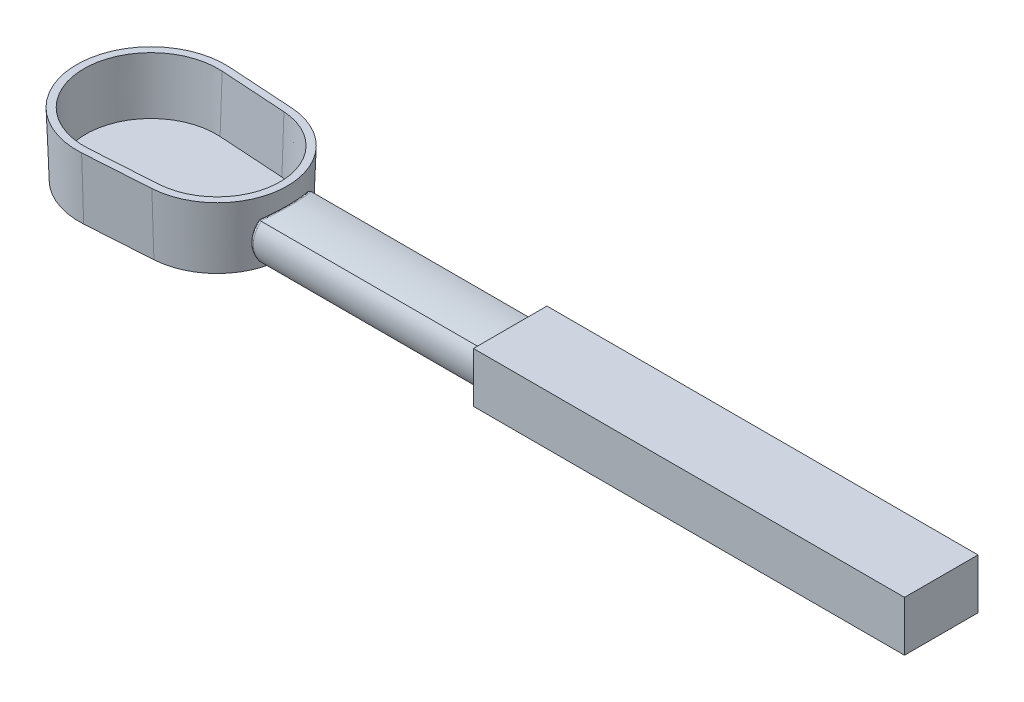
ISO-10303-21;
HEADER;
FILE_DESCRIPTION(('STEP AP214'),'2;1');
FILE_NAME('part.step','',(''),(''),'','','');
FILE_SCHEMA(('AUTOMOTIVE_DESIGN { 1 0 10303 214 1 1 1 1 }'));
ENDSEC;
DATA;
#1=APPLICATION_CONTEXT('core data for automotive mechanical design processes');
#2=APPLICATION_PROTOCOL_DEFINITION('international standard','automotive_design',2000,#1);
#3=PRODUCT_CONTEXT('',#1,'mechanical');
#4=PRODUCT('Part','Part','',(#3));
#5=PRODUCT_RELATED_PRODUCT_CATEGORY('part','',(#4));
#6=PRODUCT_DEFINITION_FORMATION('','',#4);
#7=PRODUCT_DEFINITION_CONTEXT('part definition',#1,'design');
#8=PRODUCT_DEFINITION('design','',#6,#7);
#9=PRODUCT_DEFINITION_SHAPE('','',#8);
#10=(LENGTH_UNIT() NAMED_UNIT(*) SI_UNIT(.MILLI.,.METRE.));
#11=(NAMED_UNIT(*) PLANE_ANGLE_UNIT() SI_UNIT($,.RADIAN.));
#12=(NAMED_UNIT(*) SI_UNIT($,.STERADIAN.) SOLID_ANGLE_UNIT());
#13=UNCERTAINTY_MEASURE_WITH_UNIT(LENGTH_MEASURE(1.E-05),#10,'distance_accuracy_value','');
#14=(GEOMETRIC_REPRESENTATION_CONTEXT(3) GLOBAL_UNCERTAINTY_ASSIGNED_CONTEXT((#13)) GLOBAL_UNIT_ASSIGNED_CONTEXT((#10,
#11,#12)) REPRESENTATION_CONTEXT('',''));
#15=CARTESIAN_POINT('',(0.,0.,0.));
#16=DIRECTION('',(0.,0.,1.));
#17=DIRECTION('',(1.,0.,0.));
#18=AXIS2_PLACEMENT_3D('',#15,#16,#17);
#19=CARTESIAN_POINT('',(46.8650318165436,0.,0.));
#20=DIRECTION('',(0.,1.,0.));
#21=DIRECTION('',(0.,0.,1.));
#22=AXIS2_PLACEMENT_3D('',#19,#20,#21);
#23=CONICAL_SURFACE('',#22,47.9487755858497,0.0349065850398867);
#24=CARTESIAN_POINT('',(46.8650318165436,0.,0.));
#25=DIRECTION('',(0.,1.,0.));
#26=DIRECTION('',(0.,0.,1.));
#27=AXIS2_PLACEMENT_3D('',#24,#25,#26);
#28=CIRCLE('',#27,47.9487755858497);
#29=CARTESIAN_POINT('',(49.9230325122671,0.,47.8511620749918));
#30=VERTEX_POINT('',#29);
#31=CARTESIAN_POINT('',(49.9230325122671,0.,-47.8511620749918));
#32=VERTEX_POINT('',#31);
#33=EDGE_CURVE('E154',#30,#32,#28,.T.);
#34=ORIENTED_EDGE('',*,*,#33,.T.);
#35=DIRECTION('',(0.00222576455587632,0.999390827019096,-0.0348284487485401));
#36=VECTOR('',#35,1.);
#37=CARTESIAN_POINT('',(49.9230325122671,0.,-47.8511620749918));
#38=LINE('',#37,#36);
#39=CARTESIAN_POINT('',(50.0220280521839,44.45,-49.4002302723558));
#40=VERTEX_POINT('',#39);
#41=EDGE_CURVE('E134',#40,#32,#38,.F.);
#42=ORIENTED_EDGE('',*,*,#41,.F.);
#43=CARTESIAN_POINT('',(46.8650318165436,44.45,0.));
#44=DIRECTION('',(0.,1.,0.));
#45=DIRECTION('',(0.,0.,1.));
#46=AXIS2_PLACEMENT_3D('',#43,#44,#45);
#47=CIRCLE('',#46,49.5010037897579);
#48=CARTESIAN_POINT('',(50.0220280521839,44.45,49.4002302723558));
#49=VERTEX_POINT('',#48);
#50=EDGE_CURVE('E145',#49,#40,#47,.T.);
#51=ORIENTED_EDGE('',*,*,#50,.F.);
#52=DIRECTION('',(0.00222576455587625,0.999390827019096,0.0348284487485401));
#53=VECTOR('',#52,1.);
#54=CARTESIAN_POINT('',(49.9230325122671,0.,47.8511620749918));
#55=LINE('',#54,#53);
#56=EDGE_CURVE('E131',#49,#30,#55,.F.);
#57=ORIENTED_EDGE('',*,*,#56,.T.);
#58=EDGE_LOOP('',(#34,#42,#51,#57));
#59=FACE_BOUND('',#58,.T.);
#60=ADVANCED_FACE('F36',(#59),#23,.T.);
#61=CARTESIAN_POINT('',(0.,0.,0.));
#62=DIRECTION('',(0.,1.,0.));
#63=DIRECTION('',(0.,0.,1.));
#64=AXIS2_PLACEMENT_3D('',#61,#62,#63);
#65=CONICAL_SURFACE('',#64,50.9376589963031,0.0349065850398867);
#66=CARTESIAN_POINT('',(0.,0.,0.));
#67=DIRECTION('',(0.,1.,0.));
#68=DIRECTION('',(0.,0.,1.));
#69=AXIS2_PLACEMENT_3D('',#66,#67,#68);
#70=CIRCLE('',#69,50.9376589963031);
#71=CARTESIAN_POINT('',(3.24862094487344,0.,-50.8339607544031));
#72=VERTEX_POINT('',#71);
#73=CARTESIAN_POINT('',(3.24862094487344,0.,50.8339607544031));
#74=VERTEX_POINT('',#73);
#75=EDGE_CURVE('E12',#72,#74,#70,.T.);
#76=ORIENTED_EDGE('',*,*,#75,.T.);
#77=DIRECTION('',(0.00222576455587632,0.999390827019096,0.0348284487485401));
#78=VECTOR('',#77,1.);
#79=CARTESIAN_POINT('',(3.24862094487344,0.,50.8339607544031));
#80=LINE('',#79,#78);
#81=CARTESIAN_POINT('',(3.34761648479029,44.45,52.3830289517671));
#82=VERTEX_POINT('',#81);
#83=EDGE_CURVE('E135',#82,#74,#80,.F.);
#84=ORIENTED_EDGE('',*,*,#83,.F.);
#85=CARTESIAN_POINT('',(0.,44.45,0.));
#86=DIRECTION('',(0.,1.,0.));
#87=DIRECTION('',(0.,0.,1.));
#88=AXIS2_PLACEMENT_3D('',#85,#86,#87);
#89=CIRCLE('',#88,52.4898872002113);
#90=CARTESIAN_POINT('',(3.34761648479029,44.45,-52.3830289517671));
#91=VERTEX_POINT('',#90);
#92=EDGE_CURVE('E149',#91,#82,#89,.T.);
#93=ORIENTED_EDGE('',*,*,#92,.F.);
#94=DIRECTION('',(0.00222576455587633,0.999390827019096,-0.0348284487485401));
#95=VECTOR('',#94,1.);
#96=CARTESIAN_POINT('',(3.24862094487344,0.,-50.8339607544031));
#97=LINE('',#96,#95);
#98=EDGE_CURVE('E138',#91,#72,#97,.F.);
#99=ORIENTED_EDGE('',*,*,#98,.T.);
#100=EDGE_LOOP('',(#76,#84,#93,#99));
#101=FACE_BOUND('',#100,.T.);
#102=ADVANCED_FACE('F170',(#101),#65,.T.);
#103=CARTESIAN_POINT('',(3.24862094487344,0.,50.8339607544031));
#104=DIRECTION('',(0.0637375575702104,-0.034899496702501,0.997356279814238));
#105=DIRECTION('',(0.997964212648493,0.,-0.0637764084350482));
#106=AXIS2_PLACEMENT_3D('',#103,#104,#105);
#107=PLANE('',#106);
#108=DIRECTION('',(0.997964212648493,0.,-0.0637764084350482));
#109=VECTOR('',#108,1.);
#110=CARTESIAN_POINT('',(3.24862094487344,0.,50.8339607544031));
#111=LINE('',#110,#109);
#112=EDGE_CURVE('E43',#74,#30,#111,.T.);
#113=ORIENTED_EDGE('',*,*,#112,.T.);
#114=ORIENTED_EDGE('',*,*,#56,.F.);
#115=DIRECTION('',(-0.997964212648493,0.,0.0637764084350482));
#116=VECTOR('',#115,1.);
#117=CARTESIAN_POINT('',(3.34761648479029,44.45,52.3830289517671));
#118=LINE('',#117,#116);
#119=EDGE_CURVE('E147',#82,#49,#118,.F.);
#120=ORIENTED_EDGE('',*,*,#119,.F.);
#121=ORIENTED_EDGE('',*,*,#83,.T.);
#122=EDGE_LOOP('',(#113,#114,#120,#121));
#123=FACE_BOUND('',#122,.T.);
#124=ADVANCED_FACE('F157',(#123),#107,.T.);
#125=CARTESIAN_POINT('',(3.24862094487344,0.,-50.8339607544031));
#126=DIRECTION('',(0.0637375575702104,-0.034899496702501,-0.997356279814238));
#127=DIRECTION('',(-0.997964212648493,0.,-0.0637764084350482));
#128=AXIS2_PLACEMENT_3D('',#125,#126,#127);
#129=PLANE('',#128);
#130=DIRECTION('',(-0.997964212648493,0.,-0.0637764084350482));
#131=VECTOR('',#130,1.);
#132=CARTESIAN_POINT('',(3.24862094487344,0.,-50.8339607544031));
#133=LINE('',#132,#131);
#134=EDGE_CURVE('E152',#32,#72,#133,.T.);
#135=ORIENTED_EDGE('',*,*,#134,.T.);
#136=ORIENTED_EDGE('',*,*,#98,.F.);
#137=DIRECTION('',(0.997964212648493,0.,0.0637764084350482));
#138=VECTOR('',#137,1.);
#139=CARTESIAN_POINT('',(3.34761648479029,44.45,-52.3830289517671));
#140=LINE('',#139,#138);
#141=EDGE_CURVE('E141',#40,#91,#140,.F.);
#142=ORIENTED_EDGE('',*,*,#141,.F.);
#143=ORIENTED_EDGE('',*,*,#41,.T.);
#144=EDGE_LOOP('',(#135,#136,#142,#143));
#145=FACE_BOUND('',#144,.T.);
#146=ADVANCED_FACE('F166',(#145),#129,.T.);
#147=CARTESIAN_POINT('',(0.,44.45,0.));
#148=DIRECTION('',(0.,1.,0.));
#149=DIRECTION('',(0.,0.,1.));
#150=AXIS2_PLACEMENT_3D('',#147,#148,#149);
#151=PLANE('',#150);
#152=CARTESIAN_POINT('',(0.,44.45,0.));
#153=DIRECTION('',(0.,1.,0.));
#154=DIRECTION('',(0.,0.,1.));
#155=AXIS2_PLACEMENT_3D('',#152,#153,#154);
#156=CIRCLE('',#155,47.4067907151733);
#157=CARTESIAN_POINT('',(3.02343484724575,44.45,-47.3102805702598));
#158=VERTEX_POINT('',#157);
#159=CARTESIAN_POINT('',(3.02343484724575,44.45,47.3102805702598));
#160=VERTEX_POINT('',#159);
#161=EDGE_CURVE('E120',#158,#160,#156,.T.);
#162=ORIENTED_EDGE('',*,*,#161,.F.);
#163=DIRECTION('',(0.997964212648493,0.,0.0637764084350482));
#164=VECTOR('',#163,1.);
#165=CARTESIAN_POINT('',(3.02343484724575,44.45,-47.3102805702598));
#166=LINE('',#165,#164);
#167=CARTESIAN_POINT('',(49.6978464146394,44.45,-44.3274818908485));
#168=VERTEX_POINT('',#167);
#169=EDGE_CURVE('E128',#168,#158,#166,.F.);
#170=ORIENTED_EDGE('',*,*,#169,.F.);
#171=CARTESIAN_POINT('',(46.8650318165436,44.45,0.));
#172=DIRECTION('',(0.,1.,0.));
#173=DIRECTION('',(0.,0.,1.));
#174=AXIS2_PLACEMENT_3D('',#171,#172,#173);
#175=CIRCLE('',#174,44.4179073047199);
#176=CARTESIAN_POINT('',(49.6978464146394,44.45,44.3274818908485));
#177=VERTEX_POINT('',#176);
#178=EDGE_CURVE('E112',#177,#168,#175,.T.);
#179=ORIENTED_EDGE('',*,*,#178,.F.);
#180=DIRECTION('',(-0.997964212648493,0.,0.0637764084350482));
#181=VECTOR('',#180,1.);
#182=CARTESIAN_POINT('',(3.02343484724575,44.45,47.3102805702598));
#183=LINE('',#182,#181);
#184=EDGE_CURVE('E122',#160,#177,#183,.F.);
#185=ORIENTED_EDGE('',*,*,#184,.F.);
#186=EDGE_LOOP('',(#162,#170,#179,#185));
#187=FACE_BOUND('',#186,.T.);
#188=ORIENTED_EDGE('',*,*,#92,.T.);
#189=ORIENTED_EDGE('',*,*,#119,.T.);
#190=ORIENTED_EDGE('',*,*,#50,.T.);
#191=ORIENTED_EDGE('',*,*,#141,.T.);
#192=EDGE_LOOP('',(#188,#189,#190,#191));
#193=FACE_BOUND('',#192,.T.);
#194=ADVANCED_FACE('F172',(#187,#193),#151,.T.);
#195=CARTESIAN_POINT('',(0.,0.,0.));
#196=DIRECTION('',(0.,1.,0.));
#197=DIRECTION('',(0.,0.,1.));
#198=AXIS2_PLACEMENT_3D('',#195,#196,#197);
#199=PLANE('',#198);
#200=ORIENTED_EDGE('',*,*,#75,.F.);
#201=ORIENTED_EDGE('',*,*,#134,.F.);
#202=ORIENTED_EDGE('',*,*,#33,.F.);
#203=ORIENTED_EDGE('',*,*,#112,.F.);
#204=EDGE_LOOP('',(#200,#201,#202,#203));
#205=FACE_BOUND('',#204,.T.);
#206=ADVANCED_FACE('F163',(#205),#199,.F.);
#207=CARTESIAN_POINT('',(46.8650318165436,0.177289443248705,0.));
#208=DIRECTION('',(0.,1.,0.));
#209=DIRECTION('',(0.,0.,1.));
#210=AXIS2_PLACEMENT_3D('',#207,#208,#209);
#211=CONICAL_SURFACE('',#210,42.8718701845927,0.0349065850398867);
#212=CARTESIAN_POINT('',(46.8650318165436,5.08,0.));
#213=DIRECTION('',(0.,1.,0.));
#214=DIRECTION('',(0.,0.,1.));
#215=AXIS2_PLACEMENT_3D('',#212,#213,#214);
#216=CIRCLE('',#215,43.0430766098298);
#217=CARTESIAN_POINT('',(49.610164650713,5.08,42.9554500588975));
#218=VERTEX_POINT('',#217);
#219=CARTESIAN_POINT('',(49.610164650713,5.08,-42.9554500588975));
#220=VERTEX_POINT('',#219);
#221=EDGE_CURVE('E100',#218,#220,#216,.T.);
#222=ORIENTED_EDGE('',*,*,#221,.F.);
#223=DIRECTION('',(0.00222576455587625,0.999390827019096,0.0348284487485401));
#224=VECTOR('',#223,1.);
#225=CARTESIAN_POINT('',(49.5992457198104,0.177289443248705,42.7845921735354));
#226=LINE('',#225,#224);
#227=EDGE_CURVE('E115',#177,#218,#226,.F.);
#228=ORIENTED_EDGE('',*,*,#227,.F.);
#229=ORIENTED_EDGE('',*,*,#178,.T.);
#230=DIRECTION('',(0.00222576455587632,0.999390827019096,-0.0348284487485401));
#231=VECTOR('',#230,1.);
#232=CARTESIAN_POINT('',(49.5992457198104,0.177289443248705,-42.7845921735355));
#233=LINE('',#232,#231);
#234=EDGE_CURVE('E50',#168,#220,#233,.F.);
#235=ORIENTED_EDGE('',*,*,#234,.T.);
#236=EDGE_LOOP('',(#222,#228,#229,#235));
#237=FACE_BOUND('',#236,.T.);
#238=ADVANCED_FACE('F110',(#237),#211,.F.);
#239=CARTESIAN_POINT('',(0.,0.177289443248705,0.));
#240=DIRECTION('',(0.,1.,0.));
#241=DIRECTION('',(0.,0.,1.));
#242=AXIS2_PLACEMENT_3D('',#239,#240,#241);
#243=CONICAL_SURFACE('',#242,45.8607535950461,0.0349065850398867);
#244=CARTESIAN_POINT('',(0.,5.08,0.));
#245=DIRECTION('',(0.,1.,0.));
#246=DIRECTION('',(0.,0.,1.));
#247=AXIS2_PLACEMENT_3D('',#244,#245,#246);
#248=CIRCLE('',#247,46.0319600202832);
#249=CARTESIAN_POINT('',(2.9357530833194,5.08,-45.9382487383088));
#250=VERTEX_POINT('',#249);
#251=CARTESIAN_POINT('',(2.93575308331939,5.08,45.9382487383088));
#252=VERTEX_POINT('',#251);
#253=EDGE_CURVE('E143',#250,#252,#248,.T.);
#254=ORIENTED_EDGE('',*,*,#253,.F.);
#255=DIRECTION('',(0.00222576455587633,0.999390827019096,-0.0348284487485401));
#256=VECTOR('',#255,1.);
#257=CARTESIAN_POINT('',(2.92483415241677,0.177289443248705,-45.7673908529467));
#258=LINE('',#257,#256);
#259=EDGE_CURVE('E114',#158,#250,#258,.F.);
#260=ORIENTED_EDGE('',*,*,#259,.F.);
#261=ORIENTED_EDGE('',*,*,#161,.T.);
#262=DIRECTION('',(0.00222576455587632,0.999390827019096,0.0348284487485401));
#263=VECTOR('',#262,1.);
#264=CARTESIAN_POINT('',(2.92483415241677,0.177289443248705,45.7673908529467));
#265=LINE('',#264,#263);
#266=EDGE_CURVE('E251',#160,#252,#265,.F.);
#267=ORIENTED_EDGE('',*,*,#266,.T.);
#268=EDGE_LOOP('',(#254,#260,#261,#267));
#269=FACE_BOUND('',#268,.T.);
#270=ADVANCED_FACE('F190',(#269),#243,.F.);
#271=CARTESIAN_POINT('',(2.92483415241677,0.177289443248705,45.7673908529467));
#272=DIRECTION('',(0.0637375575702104,-0.034899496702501,0.997356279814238));
#273=DIRECTION('',(0.997964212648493,0.,-0.0637764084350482));
#274=AXIS2_PLACEMENT_3D('',#271,#272,#273);
#275=PLANE('',#274);
#276=DIRECTION('',(-0.997964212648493,0.,0.0637764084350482));
#277=VECTOR('',#276,1.);
#278=CARTESIAN_POINT('',(2.93575308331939,5.08,45.9382487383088));
#279=LINE('',#278,#277);
#280=EDGE_CURVE('E105',#252,#218,#279,.F.);
#281=ORIENTED_EDGE('',*,*,#280,.F.);
#282=ORIENTED_EDGE('',*,*,#266,.F.);
#283=ORIENTED_EDGE('',*,*,#184,.T.);
#284=ORIENTED_EDGE('',*,*,#227,.T.);
#285=EDGE_LOOP('',(#281,#282,#283,#284));
#286=FACE_BOUND('',#285,.T.);
#287=ADVANCED_FACE('F196',(#286),#275,.F.);
#288=CARTESIAN_POINT('',(2.92483415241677,0.177289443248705,-45.7673908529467));
#289=DIRECTION('',(0.0637375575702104,-0.034899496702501,-0.997356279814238));
#290=DIRECTION('',(-0.997964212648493,0.,-0.0637764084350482));
#291=AXIS2_PLACEMENT_3D('',#288,#289,#290);
#292=PLANE('',#291);
#293=DIRECTION('',(0.997964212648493,0.,0.0637764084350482));
#294=VECTOR('',#293,1.);
#295=CARTESIAN_POINT('',(2.93575308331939,5.08,-45.9382487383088));
#296=LINE('',#295,#294);
#297=EDGE_CURVE('E103',#220,#250,#296,.F.);
#298=ORIENTED_EDGE('',*,*,#297,.F.);
#299=ORIENTED_EDGE('',*,*,#234,.F.);
#300=ORIENTED_EDGE('',*,*,#169,.T.);
#301=ORIENTED_EDGE('',*,*,#259,.T.);
#302=EDGE_LOOP('',(#298,#299,#300,#301));
#303=FACE_BOUND('',#302,.T.);
#304=ADVANCED_FACE('F117',(#303),#292,.F.);
#305=CARTESIAN_POINT('',(0.,5.08,0.));
#306=DIRECTION('',(0.,1.,0.));
#307=DIRECTION('',(0.,0.,1.));
#308=AXIS2_PLACEMENT_3D('',#305,#306,#307);
#309=PLANE('',#308);
#310=ORIENTED_EDGE('',*,*,#253,.T.);
#311=ORIENTED_EDGE('',*,*,#280,.T.);
#312=ORIENTED_EDGE('',*,*,#221,.T.);
#313=ORIENTED_EDGE('',*,*,#297,.T.);
#314=EDGE_LOOP('',(#310,#311,#312,#313));
#315=FACE_BOUND('',#314,.T.);
#316=ADVANCED_FACE('F102',(#315),#309,.T.);
#317=CLOSED_SHELL('',(#60,#102,#124,#146,#194,#206,#238,#270,#287,#304,#316));
#318=MANIFOLD_SOLID_BREP('B2',#317);
#319=CARTESIAN_POINT('',(46.8650318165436,0.,0.));
#320=DIRECTION('',(0.,1.,0.));
#321=DIRECTION('',(0.,0.,1.));
#322=AXIS2_PLACEMENT_3D('',#319,#320,#321);
#323=CONICAL_SURFACE('',#322,47.9487755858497,0.0349065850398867);
#324=CARTESIAN_POINT('',(96.4599326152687,33.7940453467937,-16.1593864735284));
#325=CARTESIAN_POINT('',(93.4822984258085,34.2800702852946,-15.7159306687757));
#326=CARTESIAN_POINT('',(94.0206240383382,32.1706904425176,-13.5805382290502));
#327=CARTESIAN_POINT('',(96.3391004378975,33.3370226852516,-16.576411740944));
#328=CARTESIAN_POINT('',(93.3255723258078,33.838473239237,-16.1441785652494));
#329=CARTESIAN_POINT('',(93.9050681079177,31.7667348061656,-13.9308193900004));
#330=CARTESIAN_POINT('',(96.218096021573,32.8622958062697,-16.9739962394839));
#331=CARTESIAN_POINT('',(93.1685522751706,33.3802967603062,-16.552380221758));
#332=CARTESIAN_POINT('',(93.7893271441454,31.3471306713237,-14.2647393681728));
#333=CARTESIAN_POINT('',(95.9787602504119,31.880255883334,-17.7279491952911));
#334=CARTESIAN_POINT('',(92.8552452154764,32.4260128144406,-17.3332012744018));
#335=CARTESIAN_POINT('',(93.5603484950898,30.4791199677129,-14.8978984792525));
#336=CARTESIAN_POINT('',(95.8604292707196,31.372938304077,-18.084311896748));
#337=CARTESIAN_POINT('',(92.6989989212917,31.9294480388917,-17.7052306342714));
#338=CARTESIAN_POINT('',(93.4471111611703,30.0307093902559,-15.197132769));
#339=CARTESIAN_POINT('',(95.6290139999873,30.3265009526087,-18.7547577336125));
#340=CARTESIAN_POINT('',(92.3906440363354,30.8975709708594,-18.4118219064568));
#341=CARTESIAN_POINT('',(93.2255881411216,29.1057787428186,-15.7600290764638));
#342=CARTESIAN_POINT('',(95.5159535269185,29.7872579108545,-19.0686592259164));
#343=CARTESIAN_POINT('',(92.2387252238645,30.3619180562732,-18.7454297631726));
#344=CARTESIAN_POINT('',(93.1173249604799,28.6291497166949,-16.0235382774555));
#345=CARTESIAN_POINT('',(95.2986361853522,28.6821189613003,-19.6500579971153));
#346=CARTESIAN_POINT('',(91.9439855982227,29.2551932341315,-19.3697663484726));
#347=CARTESIAN_POINT('',(92.909138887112,27.6523335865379,-16.5115242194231));
#348=CARTESIAN_POINT('',(95.1943795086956,28.1162224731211,-19.9175542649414));
#349=CARTESIAN_POINT('',(91.8014447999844,28.6842133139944,-19.6595764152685));
#350=CARTESIAN_POINT('',(92.8092161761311,27.152145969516,-16.7360001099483));
#351=CARTESIAN_POINT('',(94.9880587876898,26.9054492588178,-20.4273493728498));
#352=CARTESIAN_POINT('',(91.5166920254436,27.4515471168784,-20.2183290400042));
#353=CARTESIAN_POINT('',(92.6113507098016,26.0819612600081,-17.1637152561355));
#354=CARTESIAN_POINT('',(94.8871803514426,26.2582249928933,-20.6647148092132));
#355=CARTESIAN_POINT('',(91.3765113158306,26.787844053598,-20.4809130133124));
#356=CARTESIAN_POINT('',(92.5145325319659,25.5098892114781,-17.362805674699));
#357=CARTESIAN_POINT('',(94.7030219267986,24.9412254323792,-21.0780088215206));
#358=CARTESIAN_POINT('',(91.1185334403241,25.4250975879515,-20.943974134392));
#359=CARTESIAN_POINT('',(92.3376013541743,24.3458125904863,-17.7093326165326));
#360=CARTESIAN_POINT('',(94.6197439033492,24.2714476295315,-21.2539305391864));
#361=CARTESIAN_POINT('',(91.001325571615,24.7272963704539,-21.143126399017));
#362=CARTESIAN_POINT('',(92.2574902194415,23.753805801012,-17.8567633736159));
#363=CARTESIAN_POINT('',(94.4739422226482,22.9170119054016,-21.541518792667));
#364=CARTESIAN_POINT('',(90.7952092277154,23.3048442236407,-21.4732823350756));
#365=CARTESIAN_POINT('',(92.1169806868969,22.5566399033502,-18.0976163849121));
#366=CARTESIAN_POINT('',(94.4113709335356,22.2323920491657,-21.6533332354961));
#367=CARTESIAN_POINT('',(90.7068072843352,22.5821088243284,-21.6033123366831));
#368=CARTESIAN_POINT('',(92.0565370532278,21.9515144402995,-18.1911629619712));
#369=CARTESIAN_POINT('',(94.3089271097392,20.8535513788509,-21.8114909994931));
#370=CARTESIAN_POINT('',(90.5625528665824,21.1174150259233,-21.7911890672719));
#371=CARTESIAN_POINT('',(91.957214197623,20.732777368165,-18.3232392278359));
#372=CARTESIAN_POINT('',(94.2690497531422,20.1593326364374,-21.8578482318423));
#373=CARTESIAN_POINT('',(90.5071461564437,20.3778517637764,-21.8482737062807));
#374=CARTESIAN_POINT('',(91.9183303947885,20.1191675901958,-18.3617806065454));
#375=CARTESIAN_POINT('',(94.2177091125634,18.8812132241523,-21.882048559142));
#376=CARTESIAN_POINT('',(90.4378403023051,19.0113934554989,-21.8841538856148));
#377=CARTESIAN_POINT('',(91.8677246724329,18.9894565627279,-18.3813703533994));
#378=CARTESIAN_POINT('',(94.2026894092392,18.2976592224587,-21.8697739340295));
#379=CARTESIAN_POINT('',(90.4188142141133,18.387145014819,-21.8739526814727));
#380=CARTESIAN_POINT('',(91.852623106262,18.4736617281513,-18.3707207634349));
#381=CARTESIAN_POINT('',(94.1895288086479,17.1332021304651,-21.7985930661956));
#382=CARTESIAN_POINT('',(90.4060736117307,17.140306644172,-21.8003178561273));
#383=CARTESIAN_POINT('',(91.8384632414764,17.4444151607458,-18.3102556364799));
#384=CARTESIAN_POINT('',(94.1913857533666,16.5522987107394,-21.7396927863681));
#385=CARTESIAN_POINT('',(90.4123656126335,16.5193336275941,-21.737000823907));
#386=CARTESIAN_POINT('',(91.8394028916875,16.9309631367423,-18.2604451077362));
#387=CARTESIAN_POINT('',(94.2115472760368,15.3973951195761,-21.5757122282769));
#388=CARTESIAN_POINT('',(90.4495288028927,15.286088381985,-21.5579247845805));
#389=CARTESIAN_POINT('',(91.8569191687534,15.9101607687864,-18.1220463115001));
#390=CARTESIAN_POINT('',(94.2298529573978,14.8233954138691,-21.4706288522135));
#391=CARTESIAN_POINT('',(90.4802862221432,14.6753327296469,-21.442533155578));
#392=CARTESIAN_POINT('',(91.8734968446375,15.4028108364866,-18.0334554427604));
#393=CARTESIAN_POINT('',(94.2819538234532,13.6864668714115,-21.215198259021));
#394=CARTESIAN_POINT('',(90.5645422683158,13.4691392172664,-21.1612292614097));
#395=CARTESIAN_POINT('',(91.9213822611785,14.3978963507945,-17.8182739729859));
#396=CARTESIAN_POINT('',(94.3157495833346,13.123538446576,-21.0648493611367));
#397=CARTESIAN_POINT('',(90.617827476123,12.875006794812,-20.995899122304));
#398=CARTESIAN_POINT('',(91.9526905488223,13.9003321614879,-17.6916819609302));
#399=CARTESIAN_POINT('',(94.3973185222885,12.0139271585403,-20.7205940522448));
#400=CARTESIAN_POINT('',(90.7442660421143,11.7091202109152,-20.6179489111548));
#401=CARTESIAN_POINT('',(92.0286057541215,12.919562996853,-17.4019398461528));
#402=CARTESIAN_POINT('',(94.4450597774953,11.4672102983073,-20.5267873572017));
#403=CARTESIAN_POINT('',(90.8171022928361,11.1383417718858,-20.4061620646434));
#404=CARTESIAN_POINT('',(92.0731823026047,12.4363279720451,-17.2388734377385));
#405=CARTESIAN_POINT('',(94.5527693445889,10.3922215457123,-20.0970298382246));
#406=CARTESIAN_POINT('',(90.9793806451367,10.0223524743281,-19.938411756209));
#407=CARTESIAN_POINT('',(92.1739724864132,11.4861611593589,-16.8773756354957));
#408=CARTESIAN_POINT('',(94.6127375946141,9.86394956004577,-19.861079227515));
#409=CARTESIAN_POINT('',(91.0685393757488,9.47783881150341,-19.6832320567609));
#410=CARTESIAN_POINT('',(92.2301860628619,11.0192292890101,-16.6789444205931));
#411=CARTESIAN_POINT('',(94.7428932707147,8.82868683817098,-19.3486748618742));
#412=CARTESIAN_POINT('',(91.2598980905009,8.41754512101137,-19.1320488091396));
#413=CARTESIAN_POINT('',(92.3523455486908,10.1041757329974,-16.2481008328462));
#414=CARTESIAN_POINT('',(94.8130874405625,8.32171043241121,-19.0721943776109));
#415=CARTESIAN_POINT('',(91.3618500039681,7.90216744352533,-18.836791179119));
#416=CARTESIAN_POINT('',(92.4182978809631,9.65606671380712,-16.0156660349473));
#417=CARTESIAN_POINT('',(94.9614303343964,7.33225713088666,-18.4807842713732));
#418=CARTESIAN_POINT('',(91.5750399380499,6.90309545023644,-18.2090758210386));
#419=CARTESIAN_POINT('',(92.5577873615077,8.78150343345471,-15.5185452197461));
#420=CARTESIAN_POINT('',(95.0395794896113,6.84978156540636,-18.1658525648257));
#421=CARTESIAN_POINT('',(91.6860764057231,6.41950740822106,-17.8773214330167));
#422=CARTESIAN_POINT('',(92.6313249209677,8.35505034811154,-15.2538574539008));
#423=CARTESIAN_POINT('',(95.2045967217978,5.8939411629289,-17.486780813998));
#424=CARTESIAN_POINT('',(91.9181313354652,5.46817322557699,-17.1666979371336));
#425=CARTESIAN_POINT('',(92.7866881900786,7.51019701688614,-14.683191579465));
#426=CARTESIAN_POINT('',(95.2916843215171,5.42163679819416,-17.1212159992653));
#427=CARTESIAN_POINT('',(92.0392811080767,5.00137733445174,-16.7869927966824));
#428=CARTESIAN_POINT('',(92.8687236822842,7.09273410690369,-14.3760185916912));
#429=CARTESIAN_POINT('',(95.4692416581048,4.50893022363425,-16.3531566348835));
#430=CARTESIAN_POINT('',(92.2838495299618,4.10548493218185,-15.9944556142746));
#431=CARTESIAN_POINT('',(93.0360461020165,6.28600613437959,-13.7307070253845));
#432=CARTESIAN_POINT('',(95.5597115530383,4.06852950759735,-15.9506603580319));
#433=CARTESIAN_POINT('',(92.4072126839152,3.67602500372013,-15.5821208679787));
#434=CARTESIAN_POINT('',(93.1213331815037,5.89674239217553,-13.3925669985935));
#435=CARTESIAN_POINT('',(95.7412718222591,3.22258097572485,-15.1115820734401));
#436=CARTESIAN_POINT('',(92.6525224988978,2.85637619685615,-14.7278552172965));
#437=CARTESIAN_POINT('',(93.2925405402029,5.14902087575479,-12.6877113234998));
#438=CARTESIAN_POINT('',(95.8323614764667,2.81699836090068,-14.6750349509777));
#439=CARTESIAN_POINT('',(92.7744993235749,2.46563171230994,-14.2862739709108));
#440=CARTESIAN_POINT('',(93.3784600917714,4.79053234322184,-12.3210249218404));
#441=CARTESIAN_POINT('',(96.0126704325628,2.0425652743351,-13.7700695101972));
#442=CARTESIAN_POINT('',(93.0138652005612,1.72407815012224,-13.3763081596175));
#443=CARTESIAN_POINT('',(93.5485704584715,4.10602228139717,-11.5609358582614));
#444=CARTESIAN_POINT('',(96.1018898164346,1.67371318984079,-13.3016525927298));
#445=CARTESIAN_POINT('',(93.1313586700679,1.37264370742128,-12.9080458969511));
#446=CARTESIAN_POINT('',(93.6327613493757,3.77999932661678,-11.1675343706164));
#447=CARTESIAN_POINT('',(96.1888876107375,1.32439682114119,-12.8185660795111));
#448=CARTESIAN_POINT('',(93.2457602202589,1.03958637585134,-12.424728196));
#449=CARTESIAN_POINT('',(93.7148682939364,3.47124370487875,-10.7618378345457));
#450=(BOUNDED_SURFACE() B_SPLINE_SURFACE(3,2,((#324,#325,#326),(#327,#328,#329),(#330,#331,
#332),(#333,#334,#335),(#336,#337,#338),(#339,#340,#341),(#342,#343,#344),(#345,#346,#347),
(#348,#349,#350),(#351,#352,#353),(#354,#355,#356),(#357,#358,#359),(#360,#361,#362),(#363,#364,
#365),(#366,#367,#368),(#369,#370,#371),(#372,#373,#374),(#375,#376,#377),(#378,#379,#380),
(#381,#382,#383),(#384,#385,#386),(#387,#388,#389),(#390,#391,#392),(#393,#394,#395),(#396,#397,
#398),(#399,#400,#401),(#402,#403,#404),(#405,#406,#407),(#408,#409,#410),(#411,#412,#413),
(#414,#415,#416),(#417,#418,#419),(#420,#421,#422),(#423,#424,#425),(#426,#427,#428),(#429,#430,
#431),(#432,#433,#434),(#435,#436,#437),(#438,#439,#440),(#441,#442,#443),(#444,#445,#446),
(#447,#448,#449)),.UNSPECIFIED.,.F.,.F.,.F.) B_SPLINE_SURFACE_WITH_KNOTS((4,2,2,2,2,2,2,2,2,2,2,
2,2,2,2,2,2,2,2,2,4),(3,3),(0.,1.67967516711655,3.3595845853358,5.04646731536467,
6.73338679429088,8.58333234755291,10.4334843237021,12.2793503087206,14.1248239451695,
15.6713450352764,17.2176683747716,18.7640954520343,20.3105799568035,21.8535516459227,
23.3965155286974,24.9405016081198,26.4845714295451,28.087906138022,29.6913158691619,
31.2931039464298,32.8948216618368),(0.,1.),
.UNSPECIFIED.) GEOMETRIC_REPRESENTATION_ITEM() RATIONAL_B_SPLINE_SURFACE(((1.,0.640004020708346,
1.),(1.,0.635579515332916,1.),(1.,0.631123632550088,1.),(1.,0.622269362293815,1.),(1.,
0.617870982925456,1.),(1.,0.609235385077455,1.),(1.,0.604998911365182,1.),(1.,0.596836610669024,
1.),(1.,0.592910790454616,1.),(1.,0.585143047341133,1.),(1.,0.581345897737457,1.),(1.,
0.574451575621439,1.),(1.,0.571354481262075,1.),(1.,0.566016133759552,1.),(1.,0.563772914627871,
1.),(1.,0.560246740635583,1.),(1.,0.558963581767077,1.),(1.,0.557545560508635,1.),(1.,
0.55725835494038,1.),(1.,0.55740780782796,1.),(1.,0.557844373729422,1.),(1.,0.559417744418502,
1.),(1.,0.560554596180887,1.),(1.,0.563477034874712,1.),(1.,0.565262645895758,1.),(1.,
0.569403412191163,1.),(1.,0.571757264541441,1.),(1.,0.576946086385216,1.),(1.,0.579781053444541,
1.),(1.,0.585833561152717,1.),(1.,0.589051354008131,1.),(1.,0.595763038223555,1.),(1.,
0.599256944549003,1.),(1.,0.606553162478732,1.),(1.,0.61036216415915,1.),(1.,0.618050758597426,
1.),(1.,0.621930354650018,1.),(1.,0.629647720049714,1.),(1.,0.633485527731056,1.),(1.,
0.641024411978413,1.),(1.,0.644725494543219,1.),(1.,0.648308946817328,1.))) REPRESENTATION_ITEM('') SURFACE());
#451=CARTESIAN_POINT('',(94.0206240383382,32.1706904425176,-13.5805382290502));
#452=CARTESIAN_POINT('',(93.9050681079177,31.7667348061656,-13.9308193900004));
#453=CARTESIAN_POINT('',(93.7893271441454,31.3471306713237,-14.2647393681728));
#454=CARTESIAN_POINT('',(93.5603484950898,30.4791199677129,-14.8978984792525));
#455=CARTESIAN_POINT('',(93.4471111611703,30.0307093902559,-15.197132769));
#456=CARTESIAN_POINT('',(93.2255881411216,29.1057787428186,-15.7600290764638));
#457=CARTESIAN_POINT('',(93.1173249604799,28.6291497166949,-16.0235382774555));
#458=CARTESIAN_POINT('',(92.909138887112,27.6523335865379,-16.5115242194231));
#459=CARTESIAN_POINT('',(92.8092161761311,27.152145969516,-16.7360001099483));
#460=CARTESIAN_POINT('',(92.6113507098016,26.0819612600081,-17.1637152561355));
#461=CARTESIAN_POINT('',(92.5145325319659,25.5098892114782,-17.362805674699));
#462=CARTESIAN_POINT('',(92.3376013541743,24.3458125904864,-17.7093326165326));
#463=CARTESIAN_POINT('',(92.2574902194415,23.753805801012,-17.8567633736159));
#464=CARTESIAN_POINT('',(92.1169806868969,22.5566399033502,-18.0976163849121));
#465=CARTESIAN_POINT('',(92.0565370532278,21.9515144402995,-18.1911629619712));
#466=CARTESIAN_POINT('',(91.957214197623,20.732777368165,-18.3232392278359));
#467=CARTESIAN_POINT('',(91.9183303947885,20.1191675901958,-18.3617806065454));
#468=CARTESIAN_POINT('',(91.8677246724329,18.9894565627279,-18.3813703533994));
#469=CARTESIAN_POINT('',(91.852623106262,18.4736617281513,-18.3707207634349));
#470=CARTESIAN_POINT('',(91.8384632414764,17.4444151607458,-18.3102556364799));
#471=CARTESIAN_POINT('',(91.8394028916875,16.9309631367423,-18.2604451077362));
#472=CARTESIAN_POINT('',(91.8569191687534,15.9101607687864,-18.1220463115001));
#473=CARTESIAN_POINT('',(91.8734968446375,15.4028108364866,-18.0334554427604));
#474=CARTESIAN_POINT('',(91.9213822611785,14.3978963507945,-17.8182739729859));
#475=CARTESIAN_POINT('',(91.9526905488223,13.9003321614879,-17.6916819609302));
#476=CARTESIAN_POINT('',(92.0286057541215,12.919562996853,-17.4019398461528));
#477=CARTESIAN_POINT('',(92.0731823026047,12.4363279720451,-17.2388734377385));
#478=CARTESIAN_POINT('',(92.1739724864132,11.4861611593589,-16.8773756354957));
#479=CARTESIAN_POINT('',(92.2301860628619,11.0192292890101,-16.6789444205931));
#480=CARTESIAN_POINT('',(92.3523455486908,10.1041757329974,-16.2481008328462));
#481=CARTESIAN_POINT('',(92.4182978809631,9.65606671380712,-16.0156660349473));
#482=CARTESIAN_POINT('',(92.5577873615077,8.78150343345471,-15.5185452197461));
#483=CARTESIAN_POINT('',(92.6313249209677,8.35505034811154,-15.2538574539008));
#484=CARTESIAN_POINT('',(92.7866881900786,7.51019701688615,-14.683191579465));
#485=CARTESIAN_POINT('',(92.8687236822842,7.09273410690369,-14.3760185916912));
#486=CARTESIAN_POINT('',(93.0360461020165,6.28600613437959,-13.7307070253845));
#487=CARTESIAN_POINT('',(93.1213331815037,5.89674239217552,-13.3925669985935));
#488=CARTESIAN_POINT('',(93.2925405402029,5.14902087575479,-12.6877113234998));
#489=CARTESIAN_POINT('',(93.3784600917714,4.79053234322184,-12.3210249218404));
#490=CARTESIAN_POINT('',(93.5485704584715,4.10602228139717,-11.5609358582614));
#491=CARTESIAN_POINT('',(93.6327613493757,3.77999932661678,-11.1675343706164));
#492=CARTESIAN_POINT('',(93.7148682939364,3.47124370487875,-10.7618378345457));
#493=B_SPLINE_CURVE_WITH_KNOTS('',3,(#451,#452,#453,#454,#455,#456,#457,#458,#459,#460,#461,
#462,#463,#464,#465,#466,#467,#468,#469,#470,#471,#472,#473,#474,#475,#476,#477,#478,#479,#480,
#481,#482,#483,#484,#485,#486,#487,#488,#489,#490,#491,#492),.UNSPECIFIED.,.F.,.F.,(4,2,2,2,2,2,
2,2,2,2,2,2,2,2,2,2,2,2,2,2,4),(0.,1.67967516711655,3.3595845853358,5.04646731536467,
6.73338679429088,8.58333234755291,10.4334843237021,12.2793503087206,14.1248239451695,
15.6713450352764,17.2176683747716,18.7640954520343,20.3105799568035,21.8535516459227,
23.3965155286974,24.9405016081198,26.4845714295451,28.087906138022,29.6913158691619,
31.2931039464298,32.8948216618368),.UNSPECIFIED.);
#494=CARTESIAN_POINT('',(93.2927648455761,29.3849679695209,-15.5887305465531));
#495=VERTEX_POINT('',#494);
#496=CARTESIAN_POINT('',(92.541135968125,8.89232147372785,-15.5773478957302));
#497=VERTEX_POINT('',#496);
#498=EDGE_CURVE('E569',#495,#497,#493,.T.);
#499=ORIENTED_EDGE('',*,*,#498,.T.);
#500=CARTESIAN_POINT('',(84.0485349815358,13.7281473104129,31.0270049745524));
#501=CARTESIAN_POINT('',(83.3121830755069,10.5213674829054,31.7346788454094));
#502=CARTESIAN_POINT('',(85.9975774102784,11.2877348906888,33.6129204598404));
#503=CARTESIAN_POINT('',(84.4533900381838,13.5149070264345,30.530183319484));
#504=CARTESIAN_POINT('',(83.7348780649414,10.3332387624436,31.2387190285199));
#505=CARTESIAN_POINT('',(86.423953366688,11.0682281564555,33.0749491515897));
#506=CARTESIAN_POINT('',(84.8488601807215,13.3040038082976,30.0249012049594));
#507=CARTESIAN_POINT('',(84.1506458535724,10.1455046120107,30.7306391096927));
#508=CARTESIAN_POINT('',(86.8404591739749,10.8511271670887,32.52779709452));
#509=CARTESIAN_POINT('',(85.6205533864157,12.8879258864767,28.9977468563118));
#510=CARTESIAN_POINT('',(84.9624485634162,9.77418288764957,29.6959730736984));
#511=CARTESIAN_POINT('',(87.6532245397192,10.4228220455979,31.4154884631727));
#512=CARTESIAN_POINT('',(85.9967752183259,12.6827515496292,28.4758735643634));
#513=CARTESIAN_POINT('',(85.3588151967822,9.59049170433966,29.1693946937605));
#514=CARTESIAN_POINT('',(88.0494828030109,10.2116182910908,30.8503307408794));
#515=CARTESIAN_POINT('',(87.0961434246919,12.0772420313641,26.8854291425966));
#516=CARTESIAN_POINT('',(86.512140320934,9.04969289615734,27.5696114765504));
#517=CARTESIAN_POINT('',(89.2074339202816,9.58831478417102,29.1279145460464));
#518=CARTESIAN_POINT('',(87.7895858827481,11.6871361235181,25.7925319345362));
#519=CARTESIAN_POINT('',(87.2458821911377,8.69720368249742,26.4614283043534));
#520=CARTESIAN_POINT('',(89.9378748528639,9.1867449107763,27.9442527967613));
#521=CARTESIAN_POINT('',(89.0944662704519,10.9414576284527,23.542414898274));
#522=CARTESIAN_POINT('',(88.6257349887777,8.02177276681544,24.1748080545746));
#523=CARTESIAN_POINT('',(91.3124480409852,8.41915330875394,25.5071085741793));
#524=CARTESIAN_POINT('',(89.7055590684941,10.5860320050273,22.3849514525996));
#525=CARTESIAN_POINT('',(89.2742804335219,7.69780916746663,22.9950775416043));
#526=CARTESIAN_POINT('',(91.9562170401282,8.05328286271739,24.2533616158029));
#527=CARTESIAN_POINT('',(90.8368677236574,9.91976528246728,20.0156026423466));
#528=CARTESIAN_POINT('',(90.4735274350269,7.0897636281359,20.5767806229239));
#529=CARTESIAN_POINT('',(93.1480728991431,7.36743669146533,21.6867728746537));
#530=CARTESIAN_POINT('',(91.3571106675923,9.60891089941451,18.8037336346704));
#531=CARTESIAN_POINT('',(91.0268934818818,6.80447401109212,19.3366140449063));
#532=CARTESIAN_POINT('',(93.6961882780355,7.0474472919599,20.3739488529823));
#533=CARTESIAN_POINT('',(92.2535403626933,9.06810614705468,16.4575111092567));
#534=CARTESIAN_POINT('',(91.9794363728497,6.30774433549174,16.9325473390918));
#535=CARTESIAN_POINT('',(94.6406806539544,6.49075001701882,17.8321514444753));
#536=CARTESIAN_POINT('',(92.6389772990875,8.83315201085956,15.3277231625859));
#537=CARTESIAN_POINT('',(92.3898674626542,6.09112624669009,15.7732084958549));
#538=CARTESIAN_POINT('',(95.046799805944,6.24889132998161,16.6081363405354));
#539=CARTESIAN_POINT('',(93.3283127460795,8.41016895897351,13.0357462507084));
#540=CARTESIAN_POINT('',(93.1227608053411,5.70128911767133,13.4208478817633));
#541=CARTESIAN_POINT('',(95.7731443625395,5.81347815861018,14.1249149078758));
#542=CARTESIAN_POINT('',(93.6322127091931,8.22213920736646,11.8735578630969));
#543=CARTESIAN_POINT('',(93.4467271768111,5.52729988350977,12.2257805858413));
#544=CARTESIAN_POINT('',(96.0933712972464,5.61992281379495,12.8657092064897));
#545=CARTESIAN_POINT('',(94.1544350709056,7.89754153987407,9.5269065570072));
#546=CARTESIAN_POINT('',(94.0024242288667,5.2272346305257,9.81326283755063));
#547=CARTESIAN_POINT('',(96.6436609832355,5.28578625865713,10.3230951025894));
#548=CARTESIAN_POINT('',(94.3729758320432,7.76084234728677,8.34250870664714));
#549=CARTESIAN_POINT('',(94.2355758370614,5.10040872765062,8.59352899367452));
#550=CARTESIAN_POINT('',(96.8739538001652,5.14506991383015,9.03975737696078));
#551=CARTESIAN_POINT('',(94.7229842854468,7.54131879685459,5.95643898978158));
#552=CARTESIAN_POINT('',(94.6082291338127,4.89705530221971,6.13769391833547));
#553=CARTESIAN_POINT('',(97.2427884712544,4.91909526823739,6.45431796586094));
#554=CARTESIAN_POINT('',(94.8544521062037,7.45849435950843,4.75476714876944));
#555=CARTESIAN_POINT('',(94.7485577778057,4.82008010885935,4.89896731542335));
#556=CARTESIAN_POINT('',(97.3813304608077,4.83383688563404,5.15221630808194));
#557=CARTESIAN_POINT('',(95.0299391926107,7.34784324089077,2.32482728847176));
#558=CARTESIAN_POINT('',(94.9354547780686,4.71745740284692,2.39635198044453));
#559=CARTESIAN_POINT('',(97.5662610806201,4.7199340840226,2.51917022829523));
#560=CARTESIAN_POINT('',(95.0726347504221,7.32084909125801,1.09642892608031));
#561=CARTESIAN_POINT('',(94.9810426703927,4.69234629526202,1.12942668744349));
#562=CARTESIAN_POINT('',(97.6112547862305,4.69214666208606,1.18808421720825));
#563=CARTESIAN_POINT('',(95.0660638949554,7.32499924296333,-1.36006070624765));
#564=CARTESIAN_POINT('',(94.9740441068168,4.69619668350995,-1.40111265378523));
#565=CARTESIAN_POINT('',(97.604330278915,4.69641877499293,-1.47375413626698));
#566=CARTESIAN_POINT('',(95.0167949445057,7.35614514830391,-2.5881519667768));
#567=CARTESIAN_POINT('',(94.9214384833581,4.72516873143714,-2.66769916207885));
#568=CARTESIAN_POINT('',(97.5524093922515,4.72847996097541,-2.80450646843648));
#569=CARTESIAN_POINT('',(94.8267384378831,7.47595171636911,-5.03742777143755));
#570=CARTESIAN_POINT('',(94.7190223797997,4.83627907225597,-5.19019323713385));
#571=CARTESIAN_POINT('',(97.3521255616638,4.85180726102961,-5.45850110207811));
#572=CARTESIAN_POINT('',(94.6857471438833,7.56474041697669,-6.2585908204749));
#573=CARTESIAN_POINT('',(94.5685216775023,4.91879534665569,-6.44898694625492));
#574=CARTESIAN_POINT('',(97.2035479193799,4.94320517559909,-6.78172005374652));
#575=CARTESIAN_POINT('',(94.3138974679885,7.79780962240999,-8.68221834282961));
#576=CARTESIAN_POINT('',(94.172630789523,5.13466368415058,-8.94327100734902));
#577=CARTESIAN_POINT('',(96.8116983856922,5.18312353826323,-9.40784679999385));
#578=CARTESIAN_POINT('',(94.0830430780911,7.94208766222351,-9.88468364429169));
#579=CARTESIAN_POINT('',(93.9263384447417,5.26850338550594,-10.1815043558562));
#580=CARTESIAN_POINT('',(96.5684307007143,5.33164144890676,-10.7107554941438));
#581=CARTESIAN_POINT('',(93.5350095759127,8.28232477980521,-12.2596610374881));
#582=CARTESIAN_POINT('',(93.3432311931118,5.58293369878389,-12.6227299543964));
#583=CARTESIAN_POINT('',(95.990945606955,5.68187704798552,-13.284046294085));
#584=CARTESIAN_POINT('',(93.2180561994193,8.47814867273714,-13.4322428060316));
#585=CARTESIAN_POINT('',(93.0053684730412,5.7640801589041,-13.8282673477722));
#586=CARTESIAN_POINT('',(95.6569660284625,5.88345557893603,-14.5545040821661));
#587=CARTESIAN_POINT('',(92.5010663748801,8.91731456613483,-15.7436168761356));
#588=CARTESIAN_POINT('',(92.2431639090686,6.16866209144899,-16.1999786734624));
#589=CARTESIAN_POINT('',(94.9014879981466,6.33552715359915,-17.0587203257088));
#590=CARTESIAN_POINT('',(92.1010159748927,9.16066454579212,-16.882403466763));
#591=CARTESIAN_POINT('',(91.8172181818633,6.39291464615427,-17.3682190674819));
#592=CARTESIAN_POINT('',(94.4799748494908,6.58602841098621,-18.2924725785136));
#593=CARTESIAN_POINT('',(91.2230053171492,9.68901831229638,-19.1168273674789));
#594=CARTESIAN_POINT('',(90.8850120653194,6.87760571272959,-19.6555044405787));
#595=CARTESIAN_POINT('',(93.5548982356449,7.12990880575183,-20.7131252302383));
#596=CARTESIAN_POINT('',(90.7452635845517,9.97390504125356,-20.2125753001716));
#597=CARTESIAN_POINT('',(90.3771457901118,7.13883105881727,-20.7763628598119));
#598=CARTESIAN_POINT('',(93.0515649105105,7.42316744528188,-21.9001457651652));
#599=CARTESIAN_POINT('',(89.9730165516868,10.4284099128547,-21.8219231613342));
#600=CARTESIAN_POINT('',(89.5613094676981,7.55216562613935,-22.4133088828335));
#601=CARTESIAN_POINT('',(92.237989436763,7.89102876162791,-23.6434615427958));
#602=CARTESIAN_POINT('',(89.7063725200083,10.5844152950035,-22.3525832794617));
#603=CARTESIAN_POINT('',(89.2786823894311,7.69435662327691,-22.9544402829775));
#604=CARTESIAN_POINT('',(91.95708143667,8.05161864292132,-24.2182810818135));
#605=CARTESIAN_POINT('',(89.1550058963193,10.9047531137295,-23.4020803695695));
#606=CARTESIAN_POINT('',(88.6948528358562,7.9857166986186,-24.0235109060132));
#607=CARTESIAN_POINT('',(91.3762339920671,8.3813701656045,-25.3550832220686));
#608=CARTESIAN_POINT('',(88.8702844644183,11.0690850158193,-23.9209180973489));
#609=CARTESIAN_POINT('',(88.3933993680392,8.13499468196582,-24.5515729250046));
#610=CARTESIAN_POINT('',(91.0762957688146,8.55053125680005,-25.9170666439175));
#611=CARTESIAN_POINT('',(88.5767475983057,11.2372198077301,-24.4336493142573));
#612=CARTESIAN_POINT('',(88.0841237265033,8.28679300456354,-25.0707844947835));
#613=CARTESIAN_POINT('',(90.7670789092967,8.72360699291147,-26.4724202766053));
#614=(BOUNDED_SURFACE() B_SPLINE_SURFACE(3,2,((#500,#501,#502),(#503,#504,#505),(#506,#507,
#508),(#509,#510,#511),(#512,#513,#514),(#515,#516,#517),(#518,#519,#520),(#521,#522,#523),
(#524,#525,#526),(#527,#528,#529),(#530,#531,#532),(#533,#534,#535),(#536,#537,#538),(#539,#540,
#541),(#542,#543,#544),(#545,#546,#547),(#548,#549,#550),(#551,#552,#553),(#554,#555,#556),
(#557,#558,#559),(#560,#561,#562),(#563,#564,#565),(#566,#567,#568),(#569,#570,#571),(#572,#573,
#574),(#575,#576,#577),(#578,#579,#580),(#581,#582,#583),(#584,#585,#586),(#587,#588,#589),
(#590,#591,#592),(#593,#594,#595),(#596,#597,#598),(#599,#600,#601),(#602,#603,#604),(#605,#606,
#607),(#608,#609,#610),(#611,#612,#613)),.UNSPECIFIED.,.F.,.F.,
.F.) B_SPLINE_SURFACE_WITH_KNOTS((4,2,2,2,2,2,2,2,2,2,2,2,2,2,2,2,2,2,4),(3,3),(0.,
2.1218869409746,4.24390944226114,8.49008028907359,12.7535275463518,17.0157014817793,
20.8465725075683,24.6773752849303,28.4983130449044,32.3192451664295,36.1967552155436,
40.0743722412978,43.9606319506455,47.8467190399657,51.7227142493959,55.5993607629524,
59.4652861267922,61.3976706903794,63.3299313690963),(0.,1.),
.UNSPECIFIED.) GEOMETRIC_REPRESENTATION_ITEM() RATIONAL_B_SPLINE_SURFACE(((1.,0.602409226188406,
1.),(1.,0.605572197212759,1.),(1.,0.608689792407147,1.),(1.,0.614821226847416,1.),(1.,
0.61783505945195,1.),(1.,0.626703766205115,1.),(1.,0.632382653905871,1.),(1.,0.643185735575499,
1.),(1.,0.648307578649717,1.),(1.,0.657870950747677,1.),(1.,0.662312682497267,1.),(1.,
0.670016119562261,1.),(1.,0.67335175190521,1.),(1.,0.679343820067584,1.),(1.,0.682000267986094,
1.),(1.,0.686579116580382,1.),(1.,0.688503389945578,1.),(1.,0.691590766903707,1.),(1.,
0.692753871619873,1.),(1.,0.694307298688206,1.),(1.,0.694685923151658,1.),(1.,0.694627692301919,
1.),(1.,0.694190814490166,1.),(1.,0.692508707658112,1.),(1.,0.691261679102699,1.),(1.,
0.687983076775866,1.),(1.,0.685951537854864,1.),(1.,0.681150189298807,1.),(1.,0.678382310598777,
1.),(1.,0.672157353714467,1.),(1.,0.66870015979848,1.),(1.,0.66116796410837,1.),(1.,
0.657094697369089,1.),(1.,0.650569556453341,1.),(1.,0.648325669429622,1.),(1.,0.643708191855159,
1.),(1.,0.64133460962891,1.),(1.,0.63890045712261,1.))) REPRESENTATION_ITEM('') SURFACE());
#615=CARTESIAN_POINT('',(88.5767475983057,11.2372198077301,-24.4336493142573));
#616=CARTESIAN_POINT('',(88.8702844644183,11.0690850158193,-23.9209180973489));
#617=CARTESIAN_POINT('',(89.1550058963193,10.9047531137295,-23.4020803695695));
#618=CARTESIAN_POINT('',(89.7063725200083,10.5844152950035,-22.3525832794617));
#619=CARTESIAN_POINT('',(89.9730165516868,10.4284099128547,-21.8219231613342));
#620=CARTESIAN_POINT('',(90.7452635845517,9.97390504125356,-20.2125753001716));
#621=CARTESIAN_POINT('',(91.2230053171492,9.68901831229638,-19.1168273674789));
#622=CARTESIAN_POINT('',(92.1010159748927,9.16066454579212,-16.882403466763));
#623=CARTESIAN_POINT('',(92.5010663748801,8.91731456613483,-15.7436168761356));
#624=CARTESIAN_POINT('',(93.2180561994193,8.47814867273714,-13.4322428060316));
#625=CARTESIAN_POINT('',(93.5350095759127,8.28232477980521,-12.2596610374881));
#626=CARTESIAN_POINT('',(94.0830430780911,7.94208766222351,-9.88468364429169));
#627=CARTESIAN_POINT('',(94.3138974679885,7.79780962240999,-8.68221834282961));
#628=CARTESIAN_POINT('',(94.6857471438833,7.56474041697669,-6.2585908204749));
#629=CARTESIAN_POINT('',(94.8267384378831,7.47595171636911,-5.03742777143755));
#630=CARTESIAN_POINT('',(95.0167949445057,7.35614514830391,-2.5881519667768));
#631=CARTESIAN_POINT('',(95.0660638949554,7.32499924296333,-1.36006070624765));
#632=CARTESIAN_POINT('',(95.0726347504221,7.32084909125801,1.09642892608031));
#633=CARTESIAN_POINT('',(95.0299391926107,7.34784324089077,2.32482728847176));
#634=CARTESIAN_POINT('',(94.8544521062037,7.45849435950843,4.75476714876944));
#635=CARTESIAN_POINT('',(94.7229842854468,7.54131879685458,5.95643898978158));
#636=CARTESIAN_POINT('',(94.3729758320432,7.76084234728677,8.34250870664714));
#637=CARTESIAN_POINT('',(94.1544350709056,7.89754153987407,9.5269065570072));
#638=CARTESIAN_POINT('',(93.6322127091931,8.22213920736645,11.8735578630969));
#639=CARTESIAN_POINT('',(93.3283127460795,8.41016895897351,13.0357462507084));
#640=CARTESIAN_POINT('',(92.6389772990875,8.83315201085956,15.3277231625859));
#641=CARTESIAN_POINT('',(92.2535403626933,9.06810614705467,16.4575111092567));
#642=CARTESIAN_POINT('',(91.3571106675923,9.60891089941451,18.8037336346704));
#643=CARTESIAN_POINT('',(90.8368677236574,9.91976528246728,20.0156026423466));
#644=CARTESIAN_POINT('',(89.7055590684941,10.5860320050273,22.3849514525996));
#645=CARTESIAN_POINT('',(89.0944662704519,10.9414576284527,23.542414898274));
#646=CARTESIAN_POINT('',(87.7895858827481,11.6871361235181,25.7925319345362));
#647=CARTESIAN_POINT('',(87.0961434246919,12.0772420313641,26.8854291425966));
#648=CARTESIAN_POINT('',(85.9967752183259,12.6827515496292,28.4758735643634));
#649=CARTESIAN_POINT('',(85.6205533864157,12.8879258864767,28.9977468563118));
#650=CARTESIAN_POINT('',(84.8488601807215,13.3040038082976,30.0249012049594));
#651=CARTESIAN_POINT('',(84.4533900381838,13.5149070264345,30.530183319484));
#652=CARTESIAN_POINT('',(84.0485349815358,13.7281473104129,31.0270049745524));
#653=B_SPLINE_CURVE_WITH_KNOTS('',3,(#615,#616,#617,#618,#619,#620,#621,#622,#623,#624,#625,
#626,#627,#628,#629,#630,#631,#632,#633,#634,#635,#636,#637,#638,#639,#640,#641,#642,#643,#644,
#645,#646,#647,#648,#649,#650,#651,#652),.UNSPECIFIED.,.F.,.F.,(4,2,2,2,2,2,2,2,2,2,2,2,2,2,2,2,
2,2,4),(0.,1.93226067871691,3.86464524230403,7.73057060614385,11.6072171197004,15.4832123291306,
19.3692994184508,23.2555591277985,27.1331761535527,31.0106862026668,34.8316183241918,
38.652556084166,42.483358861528,46.314229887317,50.5764038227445,54.8398510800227,
59.0860219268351,61.2080444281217,63.3299313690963),.UNSPECIFIED.);
#654=CARTESIAN_POINT('',(92.541135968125,8.89232147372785,15.5773478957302));
#655=VERTEX_POINT('',#654);
#656=EDGE_CURVE('E574',#497,#655,#653,.T.);
#657=ORIENTED_EDGE('',*,*,#656,.T.);
#658=CARTESIAN_POINT('',(95.5512453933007,4.11576492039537,15.9837813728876));
#659=CARTESIAN_POINT('',(92.3960825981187,3.72028702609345,15.6142718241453));
#660=CARTESIAN_POINT('',(93.1133597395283,5.9384930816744,13.4204013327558));
#661=CARTESIAN_POINT('',(95.4573778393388,4.56807444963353,16.4064432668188));
#662=CARTESIAN_POINT('',(92.2675107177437,4.16361799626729,16.0495578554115));
#663=CARTESIAN_POINT('',(93.0248639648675,6.33828284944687,13.7754738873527));
#664=CARTESIAN_POINT('',(95.3644226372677,5.03853200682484,16.8099937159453));
#665=CARTESIAN_POINT('',(92.139845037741,4.62454476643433,16.4650342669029));
#666=CARTESIAN_POINT('',(92.9372571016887,6.75411339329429,14.1145235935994));
#667=CARTESIAN_POINT('',(95.1832973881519,6.01280698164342,17.5763482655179));
#668=CARTESIAN_POINT('',(91.8883159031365,5.5861104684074,17.2602690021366));
#669=CARTESIAN_POINT('',(92.7666290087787,7.6152607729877,14.758454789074));
#670=CARTESIAN_POINT('',(95.095128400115,6.51663172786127,17.9391433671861));
#671=CARTESIAN_POINT('',(91.7645566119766,6.08707636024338,17.6393812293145));
#672=CARTESIAN_POINT('',(92.6836087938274,8.06058408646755,15.0633287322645));
#673=CARTESIAN_POINT('',(94.926347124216,7.55593701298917,18.6222177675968));
#674=CARTESIAN_POINT('',(91.5248215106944,7.12848334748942,18.3589918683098));
#675=CARTESIAN_POINT('',(92.5247841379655,8.97921080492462,15.6374196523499));
#676=CARTESIAN_POINT('',(94.8457563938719,8.09150118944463,18.9423767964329));
#677=CARTESIAN_POINT('',(91.4090803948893,7.66904843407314,18.6985478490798));
#678=CARTESIAN_POINT('',(92.4490002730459,9.45258813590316,15.906535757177));
#679=CARTESIAN_POINT('',(94.6953216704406,9.18951748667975,19.5364562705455));
#680=CARTESIAN_POINT('',(91.1902414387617,8.7863407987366,19.3337587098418));
#681=CARTESIAN_POINT('',(92.3076725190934,10.4231086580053,16.4059788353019));
#682=CARTESIAN_POINT('',(94.6254771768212,9.751968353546,19.8103788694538));
#683=CARTESIAN_POINT('',(91.0874402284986,9.36274672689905,19.6284672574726));
#684=CARTESIAN_POINT('',(92.2421281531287,10.9202507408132,16.6363076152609));
#685=CARTESIAN_POINT('',(94.4961811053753,10.9277904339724,20.3217365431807));
#686=CARTESIAN_POINT('',(90.8944288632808,10.5776720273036,20.1828659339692));
#687=CARTESIAN_POINT('',(92.1209789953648,11.9595426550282,17.0663729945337));
#688=CARTESIAN_POINT('',(94.4373973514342,11.5423083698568,20.5567595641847));
#689=CARTESIAN_POINT('',(90.8055173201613,11.2167012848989,20.4388964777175));
#690=CARTESIAN_POINT('',(92.0660099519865,12.5027060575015,17.2640856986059));
#691=CARTESIAN_POINT('',(94.3373611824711,12.7917419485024,20.9709324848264));
#692=CARTESIAN_POINT('',(90.6516157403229,12.5259232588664,20.8928324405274));
#693=CARTESIAN_POINT('',(91.9727511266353,13.6070620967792,17.6126178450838));
#694=CARTESIAN_POINT('',(94.296109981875,13.4266590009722,21.1500785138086));
#695=CARTESIAN_POINT('',(90.5870332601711,13.1947456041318,21.0896468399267));
#696=CARTESIAN_POINT('',(91.9344625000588,14.1682559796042,17.7634340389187));
#697=CARTESIAN_POINT('',(94.2333686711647,14.7100789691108,21.4502030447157));
#698=CARTESIAN_POINT('',(90.4861914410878,14.5551081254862,21.4201892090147));
#699=CARTESIAN_POINT('',(91.8766763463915,15.3026520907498,18.0162342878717));
#700=CARTESIAN_POINT('',(94.211841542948,15.3585540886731,21.5712903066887));
#701=CARTESIAN_POINT('',(90.4502005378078,15.2447647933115,21.553165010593));
#702=CARTESIAN_POINT('',(91.8571436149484,15.8758297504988,18.1183096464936));
#703=CARTESIAN_POINT('',(94.1898380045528,16.6641988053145,21.7544254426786));
#704=CARTESIAN_POINT('',(90.409364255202,16.6391167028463,21.7530781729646));
#705=CARTESIAN_POINT('',(91.8380912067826,17.0298699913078,18.272884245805));
#706=CARTESIAN_POINT('',(94.1893590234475,17.3213673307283,21.8164805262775));
#707=CARTESIAN_POINT('',(90.4046782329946,17.3416151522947,21.8194954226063));
#708=CARTESIAN_POINT('',(91.8385690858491,17.6107316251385,18.3253895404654));
#709=CARTESIAN_POINT('',(94.2089246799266,18.5701656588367,21.8776592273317));
#710=CARTESIAN_POINT('',(90.4265376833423,18.678859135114,21.8811695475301));
#711=CARTESIAN_POINT('',(91.8589353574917,18.714526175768,18.377502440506));
#712=CARTESIAN_POINT('',(94.2268567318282,19.161561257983,21.8826156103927));
#713=CARTESIAN_POINT('',(90.4498798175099,19.3113211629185,21.8829818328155));
#714=CARTESIAN_POINT('',(91.8768158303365,19.2372520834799,18.3820091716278));
#715=CARTESIAN_POINT('',(94.2798530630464,20.3417973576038,21.8447346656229));
#716=CARTESIAN_POINT('',(90.5222269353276,20.5726524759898,21.8321675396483));
#717=CARTESIAN_POINT('',(91.9288566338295,20.2804454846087,18.3508698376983));
#718=CARTESIAN_POINT('',(94.3149160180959,20.9306380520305,21.801901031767));
#719=CARTESIAN_POINT('',(90.571064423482,21.1998819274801,21.7797619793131));
#720=CARTESIAN_POINT('',(91.9630157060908,20.8009131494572,18.3152268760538));
#721=CARTESIAN_POINT('',(94.401401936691,22.1015802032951,21.6690524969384));
#722=CARTESIAN_POINT('',(90.6928223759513,22.4438732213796,21.6218508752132));
#723=CARTESIAN_POINT('',(92.0468764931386,21.8358917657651,18.2042936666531));
#724=CARTESIAN_POINT('',(94.4528299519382,22.6836795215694,21.5790230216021));
#725=CARTESIAN_POINT('',(90.7654746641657,23.0591659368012,21.516801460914));
#726=CARTESIAN_POINT('',(92.0965830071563,22.3504008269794,18.1289911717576));
#727=CARTESIAN_POINT('',(94.5707502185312,23.8368539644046,21.3528438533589));
#728=CARTESIAN_POINT('',(90.9322632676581,24.2728494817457,21.2559897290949));
#729=CARTESIAN_POINT('',(92.2103034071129,23.3696748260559,17.9396216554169));
#730=CARTESIAN_POINT('',(94.6372428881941,24.4079287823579,21.2166928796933));
#731=CARTESIAN_POINT('',(91.0260569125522,24.8700413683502,21.1008911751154));
#732=CARTESIAN_POINT('',(92.2743176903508,23.8744394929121,17.8255535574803));
#733=CARTESIAN_POINT('',(94.7833498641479,25.5334718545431,20.9001898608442));
#734=CARTESIAN_POINT('',(91.2315072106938,26.0405029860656,20.7436447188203));
#735=CARTESIAN_POINT('',(92.4148012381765,24.8692905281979,17.5602564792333));
#736=CARTESIAN_POINT('',(94.8629219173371,26.0879870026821,20.7199792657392));
#737=CARTESIAN_POINT('',(91.342744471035,26.6129524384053,20.5424256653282));
#738=CARTESIAN_POINT('',(92.4912303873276,25.3594183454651,17.4091464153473));
#739=CARTESIAN_POINT('',(95.0333685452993,27.1791706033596,20.3166861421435));
#740=CARTESIAN_POINT('',(91.5796921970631,27.7321994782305,20.0959927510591));
#741=CARTESIAN_POINT('',(92.6548142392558,26.3238995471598,17.0708766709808));
#742=CARTESIAN_POINT('',(95.1242481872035,27.7158309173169,20.0935843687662));
#743=CARTESIAN_POINT('',(91.7050774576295,28.2784403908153,19.851565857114));
#744=CARTESIAN_POINT('',(92.7419737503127,26.7982457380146,16.8837008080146));
#745=CARTESIAN_POINT('',(95.3150837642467,28.7681610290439,19.6062823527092));
#746=CARTESIAN_POINT('',(91.9665399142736,29.3422110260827,19.322165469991));
#747=CARTESIAN_POINT('',(92.92489865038,27.7283849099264,16.4747837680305));
#748=CARTESIAN_POINT('',(95.4150420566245,29.2838253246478,19.3420714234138));
#749=CARTESIAN_POINT('',(92.1023477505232,29.8594891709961,19.0379583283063));
#750=CARTESIAN_POINT('',(93.0206662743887,28.1841730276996,16.2530336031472));
#751=CARTESIAN_POINT('',(95.6216599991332,30.2913161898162,18.7744456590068));
#752=CARTESIAN_POINT('',(92.3809182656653,30.8630989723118,18.4323356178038));
#753=CARTESIAN_POINT('',(93.2185461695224,29.0746794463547,15.7765551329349));
#754=CARTESIAN_POINT('',(95.7283200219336,30.7831414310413,18.4710286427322));
#755=CARTESIAN_POINT('',(92.5234895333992,31.3494457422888,18.1116141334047));
#756=CARTESIAN_POINT('',(93.3206587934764,29.5093965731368,15.5218249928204));
#757=CARTESIAN_POINT('',(95.9512894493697,31.7641131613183,17.8109659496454));
#758=CARTESIAN_POINT('',(92.8190869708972,32.3125941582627,17.4195146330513));
#759=CARTESIAN_POINT('',(93.5340623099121,30.3764631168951,14.9676083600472));
#760=CARTESIAN_POINT('',(96.0678152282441,32.2519261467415,17.4524307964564));
#761=CARTESIAN_POINT('',(92.972266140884,32.7883235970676,17.0468355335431));
#762=CARTESIAN_POINT('',(93.6455574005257,30.8076338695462,14.6665321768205));
#763=CARTESIAN_POINT('',(96.3027373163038,33.195849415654,16.6965040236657));
#764=CARTESIAN_POINT('',(93.278562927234,33.702641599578,16.267000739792));
#765=CARTESIAN_POINT('',(93.8702886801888,31.6419538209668,14.0316830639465));
#766=CARTESIAN_POINT('',(96.4211336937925,33.651958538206,16.2991109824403));
#767=CARTESIAN_POINT('',(93.4316684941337,34.1416946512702,15.8603447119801));
#768=CARTESIAN_POINT('',(93.9835249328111,32.0451019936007,13.6979089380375));
#769=CARTESIAN_POINT('',(96.6568757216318,34.5295298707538,15.4680833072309));
#770=CARTESIAN_POINT('',(93.7341605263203,34.9811947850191,15.0157361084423));
#771=CARTESIAN_POINT('',(94.2089559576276,32.8207744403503,12.9998593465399));
#772=CARTESIAN_POINT('',(96.7742221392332,34.9510196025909,15.0344780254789));
#773=CARTESIAN_POINT('',(93.8836323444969,35.3822748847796,14.5781289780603));
#774=CARTESIAN_POINT('',(94.3211514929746,33.1933230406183,12.6356085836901));
#775=CARTESIAN_POINT('',(97.0052124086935,35.7572407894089,14.1331741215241));
#776=CARTESIAN_POINT('',(94.1756652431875,36.1449699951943,13.674257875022));
#777=CARTESIAN_POINT('',(94.5419752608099,33.9059301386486,11.8784109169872));
#778=CARTESIAN_POINT('',(97.1188562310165,36.14197195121,13.6654752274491));
#779=CARTESIAN_POINT('',(94.3183904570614,36.5072830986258,13.2081154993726));
#780=CARTESIAN_POINT('',(94.6506034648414,34.2459883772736,11.485463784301));
#781=CARTESIAN_POINT('',(97.2292737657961,36.5070610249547,13.181944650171));
#782=CARTESIAN_POINT('',(94.4570532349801,36.8515605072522,12.7257184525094));
#783=CARTESIAN_POINT('',(94.7561381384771,34.568685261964,11.0791894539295));
#784=(BOUNDED_SURFACE() B_SPLINE_SURFACE(3,2,((#658,#659,#660),(#661,#662,#663),(#664,#665,
#666),(#667,#668,#669),(#670,#671,#672),(#673,#674,#675),(#676,#677,#678),(#679,#680,#681),
(#682,#683,#684),(#685,#686,#687),(#688,#689,#690),(#691,#692,#693),(#694,#695,#696),(#697,#698,
#699),(#700,#701,#702),(#703,#704,#705),(#706,#707,#708),(#709,#710,#711),(#712,#713,#714),
(#715,#716,#717),(#718,#719,#720),(#721,#722,#723),(#724,#725,#726),(#727,#728,#729),(#730,#731,
#732),(#733,#734,#735),(#736,#737,#738),(#739,#740,#741),(#742,#743,#744),(#745,#746,#747),
(#748,#749,#750),(#751,#752,#753),(#754,#755,#756),(#757,#758,#759),(#760,#761,#762),(#763,#764,
#765),(#766,#767,#768),(#769,#770,#771),(#772,#773,#774),(#775,#776,#777),(#778,#779,#780),
(#781,#782,#783)),.UNSPECIFIED.,.F.,.F.,.F.) B_SPLINE_SURFACE_WITH_KNOTS((4,2,2,2,2,2,2,2,2,2,2,
2,2,2,2,2,2,2,2,2,4),(3,3),(0.,1.66505791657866,3.33048275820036,5.00051025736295,
6.67045994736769,8.42135119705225,10.1723637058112,11.9200831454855,13.6675891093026,
15.2347824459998,16.8018546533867,18.3694110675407,19.9370110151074,21.4996429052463,
23.0629775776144,24.6267193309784,26.1905481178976,27.8316587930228,29.472829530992,
31.1126826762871,32.7525488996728),(0.,1.),
.UNSPECIFIED.) GEOMETRIC_REPRESENTATION_ITEM() RATIONAL_B_SPLINE_SURFACE(((1.,0.621556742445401,
1.),(1.,0.617541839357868,1.),(1.,0.613525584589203,1.),(1.,0.605617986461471,1.),(1.,
0.601726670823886,1.),(1.,0.594188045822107,1.),(1.,0.590541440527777,1.),(1.,0.583638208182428,
1.),(1.,0.580381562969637,1.),(1.,0.574243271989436,1.),(1.,0.571387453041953,1.),(1.,
0.566385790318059,1.),(1.,0.564239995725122,1.),(1.,0.560774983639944,1.),(1.,0.559454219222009,
1.),(1.,0.557709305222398,1.),(1.,0.557285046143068,1.),(1.,0.557358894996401,1.),(1.,
0.557766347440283,1.),(1.,0.559314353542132,1.),(1.,0.560454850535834,1.),(1.,0.563427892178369,
1.),(1.,0.565260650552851,1.),(1.,0.569550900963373,1.),(1.,0.572008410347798,1.),(1.,
0.577452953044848,1.),(1.,0.580438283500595,1.),(1.,0.586847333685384,1.),(1.,0.590271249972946,
1.),(1.,0.597453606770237,1.),(1.,0.601212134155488,1.),(1.,0.608958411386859,1.),(1.,
0.612946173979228,1.),(1.,0.621248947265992,1.),(1.,0.625570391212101,1.),(1.,0.634240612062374,
1.),(1.,0.638589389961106,1.),(1.,0.647204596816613,1.),(1.,0.651471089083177,1.),(1.,
0.659828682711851,1.),(1.,0.66391978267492,1.),(1.,0.667874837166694,1.))) REPRESENTATION_ITEM('') SURFACE());
#785=CARTESIAN_POINT('',(93.1133597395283,5.9384930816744,13.4204013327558));
#786=CARTESIAN_POINT('',(93.0248639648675,6.33828284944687,13.7754738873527));
#787=CARTESIAN_POINT('',(92.9372571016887,6.75411339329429,14.1145235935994));
#788=CARTESIAN_POINT('',(92.7666290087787,7.6152607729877,14.758454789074));
#789=CARTESIAN_POINT('',(92.6836087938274,8.06058408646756,15.0633287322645));
#790=CARTESIAN_POINT('',(92.5247841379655,8.97921080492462,15.6374196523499));
#791=CARTESIAN_POINT('',(92.4490002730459,9.45258813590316,15.906535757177));
#792=CARTESIAN_POINT('',(92.3076725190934,10.4231086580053,16.4059788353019));
#793=CARTESIAN_POINT('',(92.2421281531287,10.9202507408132,16.6363076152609));
#794=CARTESIAN_POINT('',(92.1209789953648,11.9595426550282,17.0663729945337));
#795=CARTESIAN_POINT('',(92.0660099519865,12.5027060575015,17.2640856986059));
#796=CARTESIAN_POINT('',(91.9727511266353,13.6070620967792,17.6126178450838));
#797=CARTESIAN_POINT('',(91.9344625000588,14.1682559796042,17.7634340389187));
#798=CARTESIAN_POINT('',(91.8766763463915,15.3026520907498,18.0162342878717));
#799=CARTESIAN_POINT('',(91.8571436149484,15.8758297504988,18.1183096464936));
#800=CARTESIAN_POINT('',(91.8380912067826,17.0298699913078,18.272884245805));
#801=CARTESIAN_POINT('',(91.838569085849,17.6107316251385,18.3253895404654));
#802=CARTESIAN_POINT('',(91.8589353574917,18.714526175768,18.377502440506));
#803=CARTESIAN_POINT('',(91.8768158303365,19.2372520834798,18.3820091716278));
#804=CARTESIAN_POINT('',(91.9288566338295,20.2804454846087,18.3508698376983));
#805=CARTESIAN_POINT('',(91.9630157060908,20.8009131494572,18.3152268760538));
#806=CARTESIAN_POINT('',(92.0468764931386,21.8358917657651,18.2042936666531));
#807=CARTESIAN_POINT('',(92.0965830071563,22.3504008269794,18.1289911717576));
#808=CARTESIAN_POINT('',(92.2103034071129,23.3696748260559,17.9396216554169));
#809=CARTESIAN_POINT('',(92.2743176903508,23.8744394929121,17.8255535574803));
#810=CARTESIAN_POINT('',(92.4148012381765,24.8692905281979,17.5602564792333));
#811=CARTESIAN_POINT('',(92.4912303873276,25.3594183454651,17.4091464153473));
#812=CARTESIAN_POINT('',(92.6548142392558,26.3238995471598,17.0708766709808));
#813=CARTESIAN_POINT('',(92.7419737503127,26.7982457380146,16.8837008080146));
#814=CARTESIAN_POINT('',(92.92489865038,27.7283849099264,16.4747837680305));
#815=CARTESIAN_POINT('',(93.0206662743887,28.1841730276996,16.2530336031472));
#816=CARTESIAN_POINT('',(93.2185461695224,29.0746794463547,15.7765551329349));
#817=CARTESIAN_POINT('',(93.3206587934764,29.5093965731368,15.5218249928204));
#818=CARTESIAN_POINT('',(93.5340623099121,30.3764631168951,14.9676083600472));
#819=CARTESIAN_POINT('',(93.6455574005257,30.8076338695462,14.6665321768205));
#820=CARTESIAN_POINT('',(93.8702886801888,31.6419538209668,14.0316830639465));
#821=CARTESIAN_POINT('',(93.9835249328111,32.0451019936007,13.6979089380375));
#822=CARTESIAN_POINT('',(94.2089559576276,32.8207744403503,12.9998593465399));
#823=CARTESIAN_POINT('',(94.3211514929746,33.1933230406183,12.6356085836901));
#824=CARTESIAN_POINT('',(94.54197526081,33.9059301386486,11.8784109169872));
#825=CARTESIAN_POINT('',(94.6506034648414,34.2459883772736,11.485463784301));
#826=CARTESIAN_POINT('',(94.7561381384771,34.568685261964,11.0791894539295));
#827=B_SPLINE_CURVE_WITH_KNOTS('',3,(#785,#786,#787,#788,#789,#790,#791,#792,#793,#794,#795,
#796,#797,#798,#799,#800,#801,#802,#803,#804,#805,#806,#807,#808,#809,#810,#811,#812,#813,#814,
#815,#816,#817,#818,#819,#820,#821,#822,#823,#824,#825,#826),.UNSPECIFIED.,.F.,.F.,(4,2,2,2,2,2,
2,2,2,2,2,2,2,2,2,2,2,2,2,2,4),(0.,1.66505791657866,3.33048275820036,5.00051025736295,
6.67045994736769,8.42135119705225,10.1723637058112,11.9200831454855,13.6675891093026,
15.2347824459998,16.8018546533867,18.3694110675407,19.9370110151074,21.4996429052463,
23.0629775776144,24.6267193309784,26.1905481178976,27.8316587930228,29.472829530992,
31.1126826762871,32.7525488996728),.UNSPECIFIED.);
#828=CARTESIAN_POINT('',(93.2927648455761,29.3849679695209,15.5887305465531));
#829=VERTEX_POINT('',#828);
#830=EDGE_CURVE('E605',#655,#829,#827,.T.);
#831=ORIENTED_EDGE('',*,*,#830,.T.);
#832=CARTESIAN_POINT('',(84.716279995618,24.6444103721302,-30.8162023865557));
#833=CARTESIAN_POINT('',(84.210814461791,27.6263230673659,-31.6019921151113));
#834=CARTESIAN_POINT('',(86.6848280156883,26.9103329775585,-33.3715625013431));
#835=CARTESIAN_POINT('',(85.5264471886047,25.0585287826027,-29.8440145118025));
#836=CARTESIAN_POINT('',(85.0493376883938,27.9934248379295,-30.6305779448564));
#837=CARTESIAN_POINT('',(87.5365471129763,27.336621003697,-32.3182684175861));
#838=CARTESIAN_POINT('',(86.3003492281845,25.4640446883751,-28.8378890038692));
#839=CARTESIAN_POINT('',(85.8612434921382,28.3592162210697,-29.6113592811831));
#840=CARTESIAN_POINT('',(88.3500893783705,27.7540537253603,-31.228281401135));
#841=CARTESIAN_POINT('',(87.770966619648,26.24980250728,-26.7610776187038));
#842=CARTESIAN_POINT('',(87.4039935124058,29.0702139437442,-27.5024773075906));
#843=CARTESIAN_POINT('',(89.895950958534,28.5629024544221,-28.9785170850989));
#844=CARTESIAN_POINT('',(88.4676244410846,26.630025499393,-25.6903445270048));
#845=CARTESIAN_POINT('',(88.1372157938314,29.4162419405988,-26.4125274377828));
#846=CARTESIAN_POINT('',(90.6282097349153,28.9542989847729,-27.8186887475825));
#847=CARTESIAN_POINT('',(89.7807484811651,27.3580798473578,-23.4842690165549));
#848=CARTESIAN_POINT('',(89.5184852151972,30.0803053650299,-24.1626321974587));
#849=CARTESIAN_POINT('',(92.0083706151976,29.7037485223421,-25.4291942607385));
#850=CARTESIAN_POINT('',(90.3968505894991,27.7057622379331,-22.3486644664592));
#851=CARTESIAN_POINT('',(90.1686668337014,30.3992242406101,-23.0015095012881));
#852=CARTESIAN_POINT('',(92.6558897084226,30.06164818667,-24.1992448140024));
#853=CARTESIAN_POINT('',(91.5393661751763,28.3587199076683,-20.0228732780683));
#854=CARTESIAN_POINT('',(91.3730943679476,30.998820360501,-20.6207942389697));
#855=CARTESIAN_POINT('',(93.8566146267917,30.7337941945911,-21.6803667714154));
#856=CARTESIAN_POINT('',(92.0658064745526,28.6640078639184,-18.8327030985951));
#857=CARTESIAN_POINT('',(91.9297528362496,31.2805694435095,-19.3998006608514));
#858=CARTESIAN_POINT('',(94.4098486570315,31.0480535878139,-20.3914559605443));
#859=CARTESIAN_POINT('',(92.9774680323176,29.197882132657,-16.5208528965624));
#860=CARTESIAN_POINT('',(92.8928432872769,31.7736404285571,-17.0255952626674));
#861=CARTESIAN_POINT('',(95.3678761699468,31.5976167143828,-17.8879225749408));
#862=CARTESIAN_POINT('',(93.3713918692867,29.4310170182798,-15.4035553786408));
#863=CARTESIAN_POINT('',(93.3097977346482,31.9897009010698,-15.8767084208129));
#864=CARTESIAN_POINT('',(95.7818184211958,31.8376026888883,-16.6780349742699));
#865=CARTESIAN_POINT('',(94.0773509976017,29.8516623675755,-13.135694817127));
#866=CARTESIAN_POINT('',(94.0559579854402,32.3794167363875,-13.5444953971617));
#867=CARTESIAN_POINT('',(96.5236337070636,32.2706094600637,-14.2223217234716));
#868=CARTESIAN_POINT('',(94.3893872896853,30.03917338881,-11.9851321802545));
#869=CARTESIAN_POINT('',(94.3865653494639,32.553776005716,-12.359322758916));
#870=CARTESIAN_POINT('',(96.851507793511,32.4636308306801,-12.9764965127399));
#871=CARTESIAN_POINT('',(94.9272517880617,30.3639305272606,-9.66097519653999));
#872=CARTESIAN_POINT('',(94.9554924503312,32.8554881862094,-9.96584163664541));
#873=CARTESIAN_POINT('',(97.4166615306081,32.7979315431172,-10.4599735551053));
#874=CARTESIAN_POINT('',(95.1533093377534,30.501310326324,-8.48745102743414));
#875=CARTESIAN_POINT('',(95.1951706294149,32.9835442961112,-8.75547576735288));
#876=CARTESIAN_POINT('',(97.6541821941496,32.9393484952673,-9.18935161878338));
#877=CARTESIAN_POINT('',(95.5175886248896,30.723317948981,-6.12234416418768));
#878=CARTESIAN_POINT('',(95.5806800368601,33.1901942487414,-6.3174844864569));
#879=CARTESIAN_POINT('',(98.0369291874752,33.1678802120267,-6.62860063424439));
#880=CARTESIAN_POINT('',(95.65581117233,30.8079462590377,-4.93076163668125));
#881=CARTESIAN_POINT('',(95.7272979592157,33.2692062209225,-5.0874701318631));
#882=CARTESIAN_POINT('',(98.1821563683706,33.2549954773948,-5.33847176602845));
#883=CARTESIAN_POINT('',(95.8432498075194,30.9228198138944,-2.52983604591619));
#884=CARTESIAN_POINT('',(95.9257166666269,33.3762546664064,-2.61116203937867));
#885=CARTESIAN_POINT('',(98.3790929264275,33.3732447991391,-2.73900837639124));
#886=CARTESIAN_POINT('',(95.8918380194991,30.952681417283,-1.32042707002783));
#887=CARTESIAN_POINT('',(95.9772694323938,33.4041581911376,-1.36220446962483));
#888=CARTESIAN_POINT('',(98.4301426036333,33.4039839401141,-1.42960265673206));
#889=CARTESIAN_POINT('',(95.8974289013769,30.9561145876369,1.09870027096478));
#890=CARTESIAN_POINT('',(95.983188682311,33.4073589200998,1.13338741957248));
#891=CARTESIAN_POINT('',(98.4360167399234,33.4075179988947,1.1895430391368));
#892=CARTESIAN_POINT('',(95.8544294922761,30.9296848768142,2.3084186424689));
#893=CARTESIAN_POINT('',(95.937565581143,33.382661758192,2.382680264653));
#894=CARTESIAN_POINT('',(98.390839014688,33.380311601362,2.49928302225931));
#895=CARTESIAN_POINT('',(95.6772347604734,30.8210647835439,4.72159320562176));
#896=CARTESIAN_POINT('',(95.7499860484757,33.2814346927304,4.87170289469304));
#897=CARTESIAN_POINT('',(98.2046656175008,33.26849951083,5.11200545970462));
#898=CARTESIAN_POINT('',(95.5428343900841,30.7387490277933,5.92502917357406));
#899=CARTESIAN_POINT('',(95.6074144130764,33.2045734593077,6.11402093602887));
#900=CARTESIAN_POINT('',(98.0634545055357,33.1837647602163,6.4149660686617));
#901=CARTESIAN_POINT('',(95.1844465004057,30.5202481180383,8.3138838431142));
#902=CARTESIAN_POINT('',(95.2281322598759,33.0011718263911,8.57658819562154));
#903=CARTESIAN_POINT('',(97.6868981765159,32.9588428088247,9.00142461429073));
#904=CARTESIAN_POINT('',(94.9604629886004,30.3840653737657,9.49930334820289));
#905=CARTESIAN_POINT('',(94.9906371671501,32.8742140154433,9.79930548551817));
#906=CARTESIAN_POINT('',(97.451557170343,32.818658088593,10.2849234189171));
#907=CARTESIAN_POINT('',(94.4264564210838,30.0614833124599,11.8408898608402));
#908=CARTESIAN_POINT('',(94.425785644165,32.5744978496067,12.2108183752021));
#909=CARTESIAN_POINT('',(96.8904581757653,32.4865963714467,12.8203129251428));
#910=CARTESIAN_POINT('',(94.1166608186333,29.8752167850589,12.9971255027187));
#911=CARTESIAN_POINT('',(94.0975360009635,32.4012723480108,13.4019173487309));
#912=CARTESIAN_POINT('',(96.5649392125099,32.2948560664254,14.072277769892));
#913=CARTESIAN_POINT('',(93.4143434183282,29.4564926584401,15.2765134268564));
#914=CARTESIAN_POINT('',(93.3551980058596,32.0132882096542,15.7461329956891));
#915=CARTESIAN_POINT('',(95.8269522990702,31.8638269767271,16.5404667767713));
#916=CARTESIAN_POINT('',(93.0218073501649,29.2240270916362,16.3996599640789));
#917=CARTESIAN_POINT('',(92.9396876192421,31.7978145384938,16.9011241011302));
#918=CARTESIAN_POINT('',(95.4144693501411,31.6245299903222,17.7566847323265));
#919=CARTESIAN_POINT('',(92.1592575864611,28.7185720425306,18.6035838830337));
#920=CARTESIAN_POINT('',(92.0289495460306,31.3311816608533,19.1634159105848));
#921=CARTESIAN_POINT('',(94.5080536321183,31.1042212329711,20.143336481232));
#922=CARTESIAN_POINT('',(91.6894605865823,28.4456961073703,19.6844695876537));
#923=CARTESIAN_POINT('',(91.5323184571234,31.0793416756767,20.2723795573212));
#924=CARTESIAN_POINT('',(94.0143486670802,30.8233263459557,21.3138873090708));
#925=CARTESIAN_POINT('',(90.9295721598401,28.009934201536,21.2721074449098));
#926=CARTESIAN_POINT('',(90.7334765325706,30.6801004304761,21.893265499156));
#927=CARTESIAN_POINT('',(93.2157543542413,30.374758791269,23.033307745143));
#928=CARTESIAN_POINT('',(90.6671223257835,27.860297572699,21.7956261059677));
#929=CARTESIAN_POINT('',(90.4567466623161,30.5427223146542,22.4290112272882));
#930=CARTESIAN_POINT('',(92.9399308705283,30.2207248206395,23.6002948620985));
#931=CARTESIAN_POINT('',(90.1243129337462,27.5529152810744,22.8310445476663));
#932=CARTESIAN_POINT('',(89.8849035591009,30.261035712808,23.4876965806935));
#933=CARTESIAN_POINT('',(92.3694487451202,29.90430954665,24.7217132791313));
#934=CARTESIAN_POINT('',(89.843954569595,27.3951701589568,23.3429450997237));
#935=CARTESIAN_POINT('',(89.5895669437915,30.116630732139,24.0107512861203));
#936=CARTESIAN_POINT('',(92.0747913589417,29.7419287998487,25.2761454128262));
#937=CARTESIAN_POINT('',(89.5548757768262,27.2337190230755,23.848846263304));
#938=CARTESIAN_POINT('',(89.2863607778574,29.9696326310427,24.5253888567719));
#939=CARTESIAN_POINT('',(91.7709616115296,29.5757331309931,25.8240941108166));
#940=(BOUNDED_SURFACE() B_SPLINE_SURFACE(3,2,((#832,#833,#834),(#835,#836,#837),(#838,#839,
#840),(#841,#842,#843),(#844,#845,#846),(#847,#848,#849),(#850,#851,#852),(#853,#854,#855),
(#856,#857,#858),(#859,#860,#861),(#862,#863,#864),(#865,#866,#867),(#868,#869,#870),(#871,#872,
#873),(#874,#875,#876),(#877,#878,#879),(#880,#881,#882),(#883,#884,#885),(#886,#887,#888),
(#889,#890,#891),(#892,#893,#894),(#895,#896,#897),(#898,#899,#900),(#901,#902,#903),(#904,#905,
#906),(#907,#908,#909),(#910,#911,#912),(#913,#914,#915),(#916,#917,#918),(#919,#920,#921),
(#922,#923,#924),(#925,#926,#927),(#928,#929,#930),(#931,#932,#933),(#934,#935,#936),(#937,#938,
#939)),.UNSPECIFIED.,.F.,.F.,.F.) B_SPLINE_SURFACE_WITH_KNOTS((4,2,2,2,2,2,2,2,2,2,2,2,2,2,2,2,
2,4),(3,3),(0.,4.18215494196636,8.367404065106,12.5709606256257,16.7732574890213,
20.5724241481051,24.3715443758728,28.1604583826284,31.9493374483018,35.7646577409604,
39.5800646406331,43.404059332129,47.2278829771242,51.0416666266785,54.8561085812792,
58.6600290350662,60.5613976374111,62.46263962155),(0.,1.),
.UNSPECIFIED.) GEOMETRIC_REPRESENTATION_ITEM() RATIONAL_B_SPLINE_SURFACE(((1.,0.630749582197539,
1.),(1.,0.636765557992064,1.),(1.,0.642610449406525,1.),(1.,0.653863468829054,1.),(1.,
0.659271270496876,1.),(1.,0.669568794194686,1.),(1.,0.67445614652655,1.),(1.,0.683592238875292,
1.),(1.,0.687841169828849,1.),(1.,0.695243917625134,1.),(1.,0.698463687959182,1.),(1.,
0.704257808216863,1.),(1.,0.706832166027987,1.),(1.,0.711282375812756,1.),(1.,0.713160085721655,
1.),(1.,0.716191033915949,1.),(1.,0.717344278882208,1.),(1.,0.718909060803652,1.),(1.,
0.719315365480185,1.),(1.,0.719362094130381,1.),(1.,0.719002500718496,1.),(1.,0.717523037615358,
1.),(1.,0.716401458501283,1.),(1.,0.713418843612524,1.),(1.,0.711557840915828,1.),(1.,
0.707138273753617,1.),(1.,0.704581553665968,1.),(1.,0.698815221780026,1.),(1.,0.695605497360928,
1.),(1.,0.688598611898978,1.),(1.,0.684803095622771,1.),(1.,0.678713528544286,1.),(1.,
0.676617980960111,1.),(1.,0.672302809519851,1.),(1.,0.670083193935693,1.),(1.,0.66780547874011,1.))) REPRESENTATION_ITEM('') SURFACE());
#941=CARTESIAN_POINT('',(89.5548757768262,27.2337190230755,23.848846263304));
#942=CARTESIAN_POINT('',(89.843954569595,27.3951701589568,23.3429450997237));
#943=CARTESIAN_POINT('',(90.1243129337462,27.5529152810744,22.8310445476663));
#944=CARTESIAN_POINT('',(90.6671223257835,27.860297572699,21.7956261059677));
#945=CARTESIAN_POINT('',(90.9295721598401,28.009934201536,21.2721074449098));
#946=CARTESIAN_POINT('',(91.6894605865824,28.4456961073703,19.6844695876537));
#947=CARTESIAN_POINT('',(92.1592575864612,28.7185720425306,18.6035838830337));
#948=CARTESIAN_POINT('',(93.0218073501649,29.2240270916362,16.3996599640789));
#949=CARTESIAN_POINT('',(93.4143434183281,29.4564926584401,15.2765134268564));
#950=CARTESIAN_POINT('',(94.1166608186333,29.8752167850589,12.9971255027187));
#951=CARTESIAN_POINT('',(94.4264564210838,30.0614833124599,11.8408898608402));
#952=CARTESIAN_POINT('',(94.9604629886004,30.3840653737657,9.49930334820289));
#953=CARTESIAN_POINT('',(95.1844465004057,30.5202481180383,8.3138838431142));
#954=CARTESIAN_POINT('',(95.542834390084,30.7387490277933,5.92502917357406));
#955=CARTESIAN_POINT('',(95.6772347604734,30.8210647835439,4.72159320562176));
#956=CARTESIAN_POINT('',(95.8544294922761,30.9296848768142,2.3084186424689));
#957=CARTESIAN_POINT('',(95.8974289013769,30.9561145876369,1.09870027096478));
#958=CARTESIAN_POINT('',(95.8918380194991,30.952681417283,-1.32042707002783));
#959=CARTESIAN_POINT('',(95.8432498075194,30.9228198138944,-2.52983604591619));
#960=CARTESIAN_POINT('',(95.65581117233,30.8079462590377,-4.93076163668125));
#961=CARTESIAN_POINT('',(95.5175886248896,30.723317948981,-6.12234416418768));
#962=CARTESIAN_POINT('',(95.1533093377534,30.501310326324,-8.48745102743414));
#963=CARTESIAN_POINT('',(94.9272517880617,30.3639305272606,-9.66097519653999));
#964=CARTESIAN_POINT('',(94.3893872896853,30.03917338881,-11.9851321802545));
#965=CARTESIAN_POINT('',(94.0773509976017,29.8516623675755,-13.135694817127));
#966=CARTESIAN_POINT('',(93.3713918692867,29.4310170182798,-15.4035553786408));
#967=CARTESIAN_POINT('',(92.9774680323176,29.197882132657,-16.5208528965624));
#968=CARTESIAN_POINT('',(92.0658064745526,28.6640078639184,-18.8327030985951));
#969=CARTESIAN_POINT('',(91.5393661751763,28.3587199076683,-20.0228732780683));
#970=CARTESIAN_POINT('',(90.3968505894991,27.7057622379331,-22.3486644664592));
#971=CARTESIAN_POINT('',(89.7807484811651,27.3580798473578,-23.4842690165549));
#972=CARTESIAN_POINT('',(88.4676244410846,26.630025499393,-25.6903445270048));
#973=CARTESIAN_POINT('',(87.770966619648,26.24980250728,-26.7610776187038));
#974=CARTESIAN_POINT('',(86.3003492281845,25.4640446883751,-28.8378890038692));
#975=CARTESIAN_POINT('',(85.5264471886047,25.0585287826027,-29.8440145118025));
#976=CARTESIAN_POINT('',(84.716279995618,24.6444103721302,-30.8162023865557));
#977=B_SPLINE_CURVE_WITH_KNOTS('',3,(#941,#942,#943,#944,#945,#946,#947,#948,#949,#950,#951,
#952,#953,#954,#955,#956,#957,#958,#959,#960,#961,#962,#963,#964,#965,#966,#967,#968,#969,#970,
#971,#972,#973,#974,#975,#976),.UNSPECIFIED.,.F.,.F.,(4,2,2,2,2,2,2,2,2,2,2,2,2,2,2,2,2,4),(0.,
1.90124198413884,3.80261058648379,7.60653104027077,11.4209729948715,15.2347566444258,
19.0585802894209,22.8825749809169,26.6979818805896,30.5133021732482,34.3021812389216,
38.0910952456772,41.8902154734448,45.6893821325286,49.8916789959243,54.095235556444,
58.2804846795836,62.46263962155),.UNSPECIFIED.);
#978=EDGE_CURVE('E575',#829,#495,#977,.T.);
#979=ORIENTED_EDGE('',*,*,#978,.T.);
#980=EDGE_LOOP('',(#499,#657,#831,#979));
#981=FACE_BOUND('',#980,.T.);
#982=ADVANCED_FACE('F259',(#981),#323,.F.);
#983=CARTESIAN_POINT('',(558.8,1.31685435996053,25.9873125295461));
#984=DIRECTION('',(1.,0.,0.));
#985=DIRECTION('',(0.,0.,-1.));
#986=AXIS2_PLACEMENT_3D('',#983,#984,#985);
#987=PLANE('',#986);
#988=DIRECTION('',(0.,-1.,0.));
#989=VECTOR('',#988,1.);
#990=CARTESIAN_POINT('',(558.8,36.7831456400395,25.9873125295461));
#991=LINE('',#990,#989);
#992=CARTESIAN_POINT('',(558.8,36.7831456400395,25.9873125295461));
#993=VERTEX_POINT('',#992);
#994=CARTESIAN_POINT('',(558.8,1.31685435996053,25.9873125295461));
#995=VERTEX_POINT('',#994);
#996=EDGE_CURVE('E390',#993,#995,#991,.T.);
#997=ORIENTED_EDGE('',*,*,#996,.T.);
#998=DIRECTION('',(0.,0.,-1.));
#999=VECTOR('',#998,1.);
#1000=CARTESIAN_POINT('',(558.8,1.31685435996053,25.9873125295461));
#1001=LINE('',#1000,#999);
#1002=CARTESIAN_POINT('',(558.8,1.31685435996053,-25.9873125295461));
#1003=VERTEX_POINT('',#1002);
#1004=EDGE_CURVE('E365',#995,#1003,#1001,.T.);
#1005=ORIENTED_EDGE('',*,*,#1004,.T.);
#1006=DIRECTION('',(0.,1.,0.));
#1007=VECTOR('',#1006,1.);
#1008=CARTESIAN_POINT('',(558.8,36.7831456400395,-25.9873125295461));
#1009=LINE('',#1008,#1007);
#1010=CARTESIAN_POINT('',(558.8,36.7831456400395,-25.9873125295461));
#1011=VERTEX_POINT('',#1010);
#1012=EDGE_CURVE('E393',#1003,#1011,#1009,.T.);
#1013=ORIENTED_EDGE('',*,*,#1012,.T.);
#1014=DIRECTION('',(0.,0.,1.));
#1015=VECTOR('',#1014,1.);
#1016=CARTESIAN_POINT('',(558.8,36.7831456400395,25.9873125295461));
#1017=LINE('',#1016,#1015);
#1018=EDGE_CURVE('E395',#1011,#993,#1017,.T.);
#1019=ORIENTED_EDGE('',*,*,#1018,.T.);
#1020=EDGE_LOOP('',(#997,#1005,#1013,#1019));
#1021=FACE_BOUND('',#1020,.T.);
#1022=ADVANCED_FACE('F513',(#1021),#987,.T.);
#1023=CARTESIAN_POINT('',(558.8,1.31685435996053,25.9873125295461));
#1024=DIRECTION('',(0.,1.,0.));
#1025=DIRECTION('',(0.,0.,1.));
#1026=AXIS2_PLACEMENT_3D('',#1023,#1024,#1025);
#1027=PLANE('',#1026);
#1028=DIRECTION('',(0.,0.,-1.));
#1029=VECTOR('',#1028,1.);
#1030=CARTESIAN_POINT('',(254.,1.31685435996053,25.9873125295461));
#1031=LINE('',#1030,#1029);
#1032=CARTESIAN_POINT('',(254.,1.31685435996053,25.9873125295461));
#1033=VERTEX_POINT('',#1032);
#1034=CARTESIAN_POINT('',(254.,1.31685435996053,-25.9873125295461));
#1035=VERTEX_POINT('',#1034);
#1036=EDGE_CURVE('E350',#1033,#1035,#1031,.T.);
#1037=ORIENTED_EDGE('',*,*,#1036,.T.);
#1038=DIRECTION('',(-1.,0.,0.));
#1039=VECTOR('',#1038,1.);
#1040=CARTESIAN_POINT('',(558.8,1.31685435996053,-25.9873125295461));
#1041=LINE('',#1040,#1039);
#1042=EDGE_CURVE('E370',#1003,#1035,#1041,.T.);
#1043=ORIENTED_EDGE('',*,*,#1042,.F.);
#1044=ORIENTED_EDGE('',*,*,#1004,.F.);
#1045=DIRECTION('',(-1.,0.,0.));
#1046=VECTOR('',#1045,1.);
#1047=CARTESIAN_POINT('',(558.8,1.31685435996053,25.9873125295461));
#1048=LINE('',#1047,#1046);
#1049=EDGE_CURVE('E363',#995,#1033,#1048,.T.);
#1050=ORIENTED_EDGE('',*,*,#1049,.T.);
#1051=EDGE_LOOP('',(#1037,#1043,#1044,#1050));
#1052=FACE_BOUND('',#1051,.T.);
#1053=ADVANCED_FACE('F364',(#1052),#1027,.F.);
#1054=CARTESIAN_POINT('',(558.8,36.7831456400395,-25.9873125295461));
#1055=DIRECTION('',(0.,0.,1.));
#1056=DIRECTION('',(1.,0.,0.));
#1057=AXIS2_PLACEMENT_3D('',#1054,#1055,#1056);
#1058=PLANE('',#1057);
#1059=DIRECTION('',(0.,1.,0.));
#1060=VECTOR('',#1059,1.);
#1061=CARTESIAN_POINT('',(254.,36.7831456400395,-25.9873125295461));
#1062=LINE('',#1061,#1060);
#1063=CARTESIAN_POINT('',(254.,36.7831456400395,-25.9873125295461));
#1064=VERTEX_POINT('',#1063);
#1065=EDGE_CURVE('E357',#1035,#1064,#1062,.T.);
#1066=ORIENTED_EDGE('',*,*,#1065,.T.);
#1067=DIRECTION('',(-1.,0.,0.));
#1068=VECTOR('',#1067,1.);
#1069=CARTESIAN_POINT('',(558.8,36.7831456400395,-25.9873125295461));
#1070=LINE('',#1069,#1068);
#1071=EDGE_CURVE('E398',#1011,#1064,#1070,.T.);
#1072=ORIENTED_EDGE('',*,*,#1071,.F.);
#1073=ORIENTED_EDGE('',*,*,#1012,.F.);
#1074=ORIENTED_EDGE('',*,*,#1042,.T.);
#1075=EDGE_LOOP('',(#1066,#1072,#1073,#1074));
#1076=FACE_BOUND('',#1075,.T.);
#1077=ADVANCED_FACE('F654',(#1076),#1058,.F.);
#1078=CARTESIAN_POINT('',(558.8,36.7831456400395,25.9873125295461));
#1079=DIRECTION('',(0.,-1.,0.));
#1080=DIRECTION('',(0.,0.,-1.));
#1081=AXIS2_PLACEMENT_3D('',#1078,#1079,#1080);
#1082=PLANE('',#1081);
#1083=DIRECTION('',(0.,0.,1.));
#1084=VECTOR('',#1083,1.);
#1085=CARTESIAN_POINT('',(254.,36.7831456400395,25.9873125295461));
#1086=LINE('',#1085,#1084);
#1087=CARTESIAN_POINT('',(254.,36.7831456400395,25.9873125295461));
#1088=VERTEX_POINT('',#1087);
#1089=EDGE_CURVE('E388',#1064,#1088,#1086,.T.);
#1090=ORIENTED_EDGE('',*,*,#1089,.T.);
#1091=DIRECTION('',(-1.,0.,0.));
#1092=VECTOR('',#1091,1.);
#1093=CARTESIAN_POINT('',(558.8,36.7831456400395,25.9873125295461));
#1094=LINE('',#1093,#1092);
#1095=EDGE_CURVE('E375',#993,#1088,#1094,.T.);
#1096=ORIENTED_EDGE('',*,*,#1095,.F.);
#1097=ORIENTED_EDGE('',*,*,#1018,.F.);
#1098=ORIENTED_EDGE('',*,*,#1071,.T.);
#1099=EDGE_LOOP('',(#1090,#1096,#1097,#1098));
#1100=FACE_BOUND('',#1099,.T.);
#1101=ADVANCED_FACE('F650',(#1100),#1082,.F.);
#1102=CARTESIAN_POINT('',(558.8,36.7831456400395,25.9873125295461));
#1103=DIRECTION('',(0.,0.,-1.));
#1104=DIRECTION('',(-1.,0.,0.));
#1105=AXIS2_PLACEMENT_3D('',#1102,#1103,#1104);
#1106=PLANE('',#1105);
#1107=DIRECTION('',(0.,-1.,0.));
#1108=VECTOR('',#1107,1.);
#1109=CARTESIAN_POINT('',(254.,36.7831456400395,25.9873125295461));
#1110=LINE('',#1109,#1108);
#1111=EDGE_CURVE('E356',#1088,#1033,#1110,.T.);
#1112=ORIENTED_EDGE('',*,*,#1111,.T.);
#1113=ORIENTED_EDGE('',*,*,#1049,.F.);
#1114=ORIENTED_EDGE('',*,*,#996,.F.);
#1115=ORIENTED_EDGE('',*,*,#1095,.T.);
#1116=EDGE_LOOP('',(#1112,#1113,#1114,#1115));
#1117=FACE_BOUND('',#1116,.T.);
#1118=ADVANCED_FACE('F373',(#1117),#1106,.F.);
#1119=CARTESIAN_POINT('',(254.,19.05,0.));
#1120=DIRECTION('',(-1.,0.,0.));
#1121=DIRECTION('',(0.,0.,1.));
#1122=AXIS2_PLACEMENT_3D('',#1119,#1120,#1121);
#1123=CYLINDRICAL_SURFACE('',#1122,21.8749318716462);
#1124=DIRECTION('',(-1.,0.,0.));
#1125=VECTOR('',#1124,1.);
#1126=CARTESIAN_POINT('',(254.,31.5803711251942,17.9304892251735));
#1127=LINE('',#1126,#1125);
#1128=CARTESIAN_POINT('',(254.,31.5803711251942,17.9304892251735));
#1129=VERTEX_POINT('',#1128);
#1130=CARTESIAN_POINT('',(95.9102819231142,31.5803711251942,17.9304892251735));
#1131=VERTEX_POINT('',#1130);
#1132=EDGE_CURVE('E421',#1129,#1131,#1127,.T.);
#1133=ORIENTED_EDGE('',*,*,#1132,.T.);
#1134=CARTESIAN_POINT('',(97.2292737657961,36.5070610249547,13.181944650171));
#1135=CARTESIAN_POINT('',(97.1188562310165,36.1419719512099,13.6654752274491));
#1136=CARTESIAN_POINT('',(97.0052124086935,35.7572407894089,14.1331741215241));
#1137=CARTESIAN_POINT('',(96.7742221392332,34.9510196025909,15.0344780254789));
#1138=CARTESIAN_POINT('',(96.6568757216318,34.5295298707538,15.4680833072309));
#1139=CARTESIAN_POINT('',(96.4211336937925,33.651958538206,16.2991109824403));
#1140=CARTESIAN_POINT('',(96.3027373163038,33.195849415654,16.6965040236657));
#1141=CARTESIAN_POINT('',(96.0678152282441,32.2519261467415,17.4524307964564));
#1142=CARTESIAN_POINT('',(95.9512894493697,31.7641131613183,17.8109659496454));
#1143=CARTESIAN_POINT('',(95.7283200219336,30.7831414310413,18.4710286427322));
#1144=CARTESIAN_POINT('',(95.6216599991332,30.2913161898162,18.7744456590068));
#1145=CARTESIAN_POINT('',(95.4150420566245,29.2838253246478,19.3420714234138));
#1146=CARTESIAN_POINT('',(95.3150837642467,28.7681610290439,19.6062823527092));
#1147=CARTESIAN_POINT('',(95.1242481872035,27.7158309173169,20.0935843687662));
#1148=CARTESIAN_POINT('',(95.0333685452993,27.1791706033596,20.3166861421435));
#1149=CARTESIAN_POINT('',(94.8629219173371,26.0879870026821,20.7199792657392));
#1150=CARTESIAN_POINT('',(94.7833498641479,25.5334718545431,20.9001898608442));
#1151=CARTESIAN_POINT('',(94.6372428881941,24.4079287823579,21.2166928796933));
#1152=CARTESIAN_POINT('',(94.5707502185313,23.8368539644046,21.3528438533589));
#1153=CARTESIAN_POINT('',(94.4528299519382,22.6836795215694,21.579023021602));
#1154=CARTESIAN_POINT('',(94.401401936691,22.1015802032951,21.6690524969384));
#1155=CARTESIAN_POINT('',(94.3149160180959,20.9306380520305,21.801901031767));
#1156=CARTESIAN_POINT('',(94.2798530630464,20.3417973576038,21.8447346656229));
#1157=CARTESIAN_POINT('',(94.2268567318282,19.161561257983,21.8826156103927));
#1158=CARTESIAN_POINT('',(94.2089246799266,18.5701656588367,21.8776592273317));
#1159=CARTESIAN_POINT('',(94.1893590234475,17.3213673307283,21.8164805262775));
#1160=CARTESIAN_POINT('',(94.1898380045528,16.6641988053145,21.7544254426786));
#1161=CARTESIAN_POINT('',(94.211841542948,15.3585540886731,21.5712903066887));
#1162=CARTESIAN_POINT('',(94.2333686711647,14.7100789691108,21.4502030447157));
#1163=CARTESIAN_POINT('',(94.296109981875,13.4266590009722,21.1500785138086));
#1164=CARTESIAN_POINT('',(94.3373611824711,12.7917419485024,20.9709324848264));
#1165=CARTESIAN_POINT('',(94.4373973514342,11.5423083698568,20.5567595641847));
#1166=CARTESIAN_POINT('',(94.4961811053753,10.9277904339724,20.3217365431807));
#1167=CARTESIAN_POINT('',(94.6254771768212,9.751968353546,19.8103788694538));
#1168=CARTESIAN_POINT('',(94.6953216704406,9.18951748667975,19.5364562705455));
#1169=CARTESIAN_POINT('',(94.8457563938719,8.09150118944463,18.9423767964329));
#1170=CARTESIAN_POINT('',(94.926347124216,7.55593701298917,18.6222177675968));
#1171=CARTESIAN_POINT('',(95.095128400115,6.51663172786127,17.9391433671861));
#1172=CARTESIAN_POINT('',(95.1832973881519,6.01280698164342,17.5763482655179));
#1173=CARTESIAN_POINT('',(95.3644226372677,5.03853200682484,16.8099937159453));
#1174=CARTESIAN_POINT('',(95.4573778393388,4.56807444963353,16.4064432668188));
#1175=CARTESIAN_POINT('',(95.5512453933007,4.11576492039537,15.9837813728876));
#1176=B_SPLINE_CURVE_WITH_KNOTS('',3,(#1134,#1135,#1136,#1137,#1138,#1139,#1140,#1141,#1142,
#1143,#1144,#1145,#1146,#1147,#1148,#1149,#1150,#1151,#1152,#1153,#1154,#1155,#1156,#1157,#1158,
#1159,#1160,#1161,#1162,#1163,#1164,#1165,#1166,#1167,#1168,#1169,#1170,#1171,#1172,#1173,#1174,
#1175),.UNSPECIFIED.,.F.,.F.,(4,2,2,2,2,2,2,2,2,2,2,2,2,2,2,2,2,2,2,2,4),(0.,1.63986622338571,
3.2797193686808,4.92089010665,6.56200078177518,8.12582956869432,9.68957132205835,
11.2529059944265,12.8155378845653,14.383137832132,15.9506942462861,17.5177664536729,
19.0849597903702,20.8324657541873,22.5801851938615,24.3311977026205,26.0820889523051,
27.7520386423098,29.4220661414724,31.0874909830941,32.7525488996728),.UNSPECIFIED.);
#1177=CARTESIAN_POINT('',(95.0967274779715,6.51962887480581,17.9304892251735));
#1178=VERTEX_POINT('',#1177);
#1179=EDGE_CURVE('E34',#1131,#1178,#1176,.T.);
#1180=ORIENTED_EDGE('',*,*,#1179,.T.);
#1181=DIRECTION('',(-1.,0.,0.));
#1182=VECTOR('',#1181,1.);
#1183=CARTESIAN_POINT('',(254.,6.51962887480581,17.9304892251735));
#1184=LINE('',#1183,#1182);
#1185=CARTESIAN_POINT('',(254.,6.51962887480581,17.9304892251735));
#1186=VERTEX_POINT('',#1185);
#1187=EDGE_CURVE('E418',#1186,#1178,#1184,.T.);
#1188=ORIENTED_EDGE('',*,*,#1187,.F.);
#1189=CARTESIAN_POINT('',(254.,19.05,0.));
#1190=DIRECTION('',(1.,0.,0.));
#1191=DIRECTION('',(0.,0.,-1.));
#1192=AXIS2_PLACEMENT_3D('',#1189,#1190,#1191);
#1193=CIRCLE('',#1192,21.8749318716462);
#1194=EDGE_CURVE('E404',#1129,#1186,#1193,.T.);
#1195=ORIENTED_EDGE('',*,*,#1194,.F.);
#1196=EDGE_LOOP('',(#1133,#1180,#1188,#1195));
#1197=FACE_BOUND('',#1196,.T.);
#1198=ADVANCED_FACE('F451',(#1197),#1123,.T.);
#1199=CARTESIAN_POINT('',(254.,1.31685435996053,25.9873125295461));
#1200=DIRECTION('',(1.,0.,0.));
#1201=DIRECTION('',(0.,0.,-1.));
#1202=AXIS2_PLACEMENT_3D('',#1199,#1200,#1201);
#1203=PLANE('',#1202);
#1204=ORIENTED_EDGE('',*,*,#1111,.F.);
#1205=ORIENTED_EDGE('',*,*,#1089,.F.);
#1206=ORIENTED_EDGE('',*,*,#1065,.F.);
#1207=ORIENTED_EDGE('',*,*,#1036,.F.);
#1208=EDGE_LOOP('',(#1204,#1205,#1206,#1207));
#1209=FACE_BOUND('',#1208,.T.);
#1210=CARTESIAN_POINT('',(254.,19.05,0.));
#1211=DIRECTION('',(1.,0.,0.));
#1212=DIRECTION('',(0.,0.,-1.));
#1213=AXIS2_PLACEMENT_3D('',#1210,#1211,#1212);
#1214=CIRCLE('',#1213,21.8749318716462);
#1215=CARTESIAN_POINT('',(254.,6.51962887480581,-17.9304892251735));
#1216=VERTEX_POINT('',#1215);
#1217=CARTESIAN_POINT('',(254.,31.5803711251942,-17.9304892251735));
#1218=VERTEX_POINT('',#1217);
#1219=EDGE_CURVE('E410',#1216,#1218,#1214,.T.);
#1220=ORIENTED_EDGE('',*,*,#1219,.T.);
#1221=CARTESIAN_POINT('',(254.,-55.5675247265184,0.));
#1222=DIRECTION('',(1.,0.,0.));
#1223=DIRECTION('',(0.,0.,1.));
#1224=AXIS2_PLACEMENT_3D('',#1221,#1222,#1223);
#1225=CIRCLE('',#1224,88.9733566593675);
#1226=EDGE_CURVE('E369',#1218,#1129,#1225,.T.);
#1227=ORIENTED_EDGE('',*,*,#1226,.T.);
#1228=ORIENTED_EDGE('',*,*,#1194,.T.);
#1229=CARTESIAN_POINT('',(254.,93.6675247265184,0.));
#1230=DIRECTION('',(1.,0.,0.));
#1231=DIRECTION('',(0.,0.,-1.));
#1232=AXIS2_PLACEMENT_3D('',#1229,#1230,#1231);
#1233=CIRCLE('',#1232,88.9733566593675);
#1234=EDGE_CURVE('E407',#1186,#1216,#1233,.T.);
#1235=ORIENTED_EDGE('',*,*,#1234,.T.);
#1236=EDGE_LOOP('',(#1220,#1227,#1228,#1235));
#1237=FACE_BOUND('',#1236,.T.);
#1238=ADVANCED_FACE('F352',(#1209,#1237),#1203,.F.);
#1239=CARTESIAN_POINT('',(254.,-55.5675247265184,0.));
#1240=DIRECTION('',(-1.,0.,0.));
#1241=DIRECTION('',(0.,0.,1.));
#1242=AXIS2_PLACEMENT_3D('',#1239,#1240,#1241);
#1243=CYLINDRICAL_SURFACE('',#1242,88.9733566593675);
#1244=DIRECTION('',(-1.,0.,0.));
#1245=VECTOR('',#1244,1.);
#1246=CARTESIAN_POINT('',(254.,31.5803711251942,-17.9304892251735));
#1247=LINE('',#1246,#1245);
#1248=CARTESIAN_POINT('',(95.9102819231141,31.5803711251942,-17.9304892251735));
#1249=VERTEX_POINT('',#1248);
#1250=EDGE_CURVE('E413',#1218,#1249,#1247,.T.);
#1251=ORIENTED_EDGE('',*,*,#1250,.T.);
#1252=CARTESIAN_POINT('',(95.9102819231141,31.5803711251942,-17.9304892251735));
#1253=CARTESIAN_POINT('',(95.864069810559,31.5803697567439,-17.9304947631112));
#1254=CARTESIAN_POINT('',(95.8178510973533,31.580727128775,-17.92875892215));
#1255=CARTESIAN_POINT('',(95.725983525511,31.5821636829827,-17.9217752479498));
#1256=CARTESIAN_POINT('',(95.6803329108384,31.5832383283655,-17.9165494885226));
#1257=CARTESIAN_POINT('',(95.5895960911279,31.5861136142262,-17.9025576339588));
#1258=CARTESIAN_POINT('',(95.5445099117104,31.5879142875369,-17.8937913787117));
#1259=CARTESIAN_POINT('',(95.4549159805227,31.5922440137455,-17.8726891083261));
#1260=CARTESIAN_POINT('',(95.4104136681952,31.5947775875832,-17.8603309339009));
#1261=CARTESIAN_POINT('',(95.3664963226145,31.5976673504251,-17.8462176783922));
#1262=B_SPLINE_CURVE_WITH_KNOTS('',3,(#1252,#1253,#1254,#1255,#1256,#1257,#1258,#1259,#1260,
#1261),.UNSPECIFIED.,.F.,.F.,(4,2,2,2,4),(0.,0.138611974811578,0.276355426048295,
0.414105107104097,0.552723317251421),.UNSPECIFIED.);
#1263=CARTESIAN_POINT('',(95.3664963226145,31.5976673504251,-17.8462176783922));
#1264=VERTEX_POINT('',#1263);
#1265=EDGE_CURVE('E272',#1249,#1264,#1262,.T.);
#1266=ORIENTED_EDGE('',*,*,#1265,.T.);
#1267=CARTESIAN_POINT('',(86.6848280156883,26.9103329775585,-33.3715625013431));
#1268=CARTESIAN_POINT('',(87.5365471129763,27.336621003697,-32.3182684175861));
#1269=CARTESIAN_POINT('',(88.3500893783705,27.7540537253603,-31.228281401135));
#1270=CARTESIAN_POINT('',(89.895950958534,28.5629024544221,-28.9785170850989));
#1271=CARTESIAN_POINT('',(90.6282097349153,28.9542989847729,-27.8186887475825));
#1272=CARTESIAN_POINT('',(92.0083706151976,29.7037485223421,-25.4291942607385));
#1273=CARTESIAN_POINT('',(92.6558897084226,30.06164818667,-24.1992448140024));
#1274=CARTESIAN_POINT('',(93.8566146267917,30.7337941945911,-21.6803667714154));
#1275=CARTESIAN_POINT('',(94.4098486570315,31.0480535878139,-20.3914559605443));
#1276=CARTESIAN_POINT('',(95.3678761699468,31.5976167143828,-17.8879225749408));
#1277=CARTESIAN_POINT('',(95.7818184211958,31.8376026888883,-16.6780349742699));
#1278=CARTESIAN_POINT('',(96.5236337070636,32.2706094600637,-14.2223217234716));
#1279=CARTESIAN_POINT('',(96.851507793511,32.4636308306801,-12.9764965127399));
#1280=CARTESIAN_POINT('',(97.4166615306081,32.7979315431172,-10.4599735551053));
#1281=CARTESIAN_POINT('',(97.6541821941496,32.9393484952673,-9.18935161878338));
#1282=CARTESIAN_POINT('',(98.0369291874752,33.1678802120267,-6.62860063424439));
#1283=CARTESIAN_POINT('',(98.1821563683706,33.2549954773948,-5.33847176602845));
#1284=CARTESIAN_POINT('',(98.3790929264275,33.3732447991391,-2.73900837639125));
#1285=CARTESIAN_POINT('',(98.4301426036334,33.4039839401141,-1.42960265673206));
#1286=CARTESIAN_POINT('',(98.4360167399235,33.4075179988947,1.1895430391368));
#1287=CARTESIAN_POINT('',(98.390839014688,33.380311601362,2.49928302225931));
#1288=CARTESIAN_POINT('',(98.2046656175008,33.26849951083,5.11200545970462));
#1289=CARTESIAN_POINT('',(98.0634545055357,33.1837647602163,6.4149660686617));
#1290=CARTESIAN_POINT('',(97.6868981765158,32.9588428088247,9.00142461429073));
#1291=CARTESIAN_POINT('',(97.451557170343,32.818658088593,10.2849234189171));
#1292=CARTESIAN_POINT('',(96.8904581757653,32.4865963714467,12.8203129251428));
#1293=CARTESIAN_POINT('',(96.5649392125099,32.2948560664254,14.072277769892));
#1294=CARTESIAN_POINT('',(95.8269522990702,31.8638269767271,16.5404667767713));
#1295=CARTESIAN_POINT('',(95.4144693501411,31.6245299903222,17.7566847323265));
#1296=CARTESIAN_POINT('',(94.5080536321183,31.1042212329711,20.143336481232));
#1297=CARTESIAN_POINT('',(94.0143486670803,30.8233263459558,21.3138873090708));
#1298=CARTESIAN_POINT('',(93.2157543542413,30.374758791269,23.033307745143));
#1299=CARTESIAN_POINT('',(92.9399308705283,30.2207248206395,23.6002948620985));
#1300=CARTESIAN_POINT('',(92.3694487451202,29.90430954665,24.7217132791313));
#1301=CARTESIAN_POINT('',(92.0747913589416,29.7419287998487,25.2761454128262));
#1302=CARTESIAN_POINT('',(91.7709616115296,29.5757331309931,25.8240941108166));
#1303=B_SPLINE_CURVE_WITH_KNOTS('',3,(#1267,#1268,#1269,#1270,#1271,#1272,#1273,#1274,#1275,
#1276,#1277,#1278,#1279,#1280,#1281,#1282,#1283,#1284,#1285,#1286,#1287,#1288,#1289,#1290,#1291,
#1292,#1293,#1294,#1295,#1296,#1297,#1298,#1299,#1300,#1301,#1302),.UNSPECIFIED.,.F.,.F.,(4,2,2,
2,2,2,2,2,2,2,2,2,2,2,2,2,2,4),(0.,4.18215494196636,8.367404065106,12.5709606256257,
16.7732574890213,20.5724241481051,24.3715443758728,28.1604583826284,31.9493374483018,
35.7646577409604,39.5800646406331,43.404059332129,47.2278829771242,51.0416666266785,
54.8561085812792,58.6600290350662,60.5613976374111,62.46263962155),.UNSPECIFIED.);
#1304=CARTESIAN_POINT('',(95.3664963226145,31.5976673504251,17.8462176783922));
#1305=VERTEX_POINT('',#1304);
#1306=EDGE_CURVE('E282',#1264,#1305,#1303,.T.);
#1307=ORIENTED_EDGE('',*,*,#1306,.T.);
#1308=CARTESIAN_POINT('',(95.3664963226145,31.5976673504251,17.8462176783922));
#1309=CARTESIAN_POINT('',(95.4104131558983,31.5947771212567,17.8603332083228));
#1310=CARTESIAN_POINT('',(95.4549153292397,31.5922433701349,17.8726922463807));
#1311=CARTESIAN_POINT('',(95.5445092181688,31.5879135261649,17.893795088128));
#1312=CARTESIAN_POINT('',(95.5895954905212,31.5861129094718,17.9025610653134));
#1313=CARTESIAN_POINT('',(95.6803324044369,31.5832376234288,17.9165529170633));
#1314=CARTESIAN_POINT('',(95.7259830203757,31.5821629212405,17.9217789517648));
#1315=CARTESIAN_POINT('',(95.8178507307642,31.5807264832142,17.928762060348));
#1316=CARTESIAN_POINT('',(95.8640695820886,31.5803692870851,17.930497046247));
#1317=CARTESIAN_POINT('',(95.9102819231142,31.5803711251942,17.9304892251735));
#1318=B_SPLINE_CURVE_WITH_KNOTS('',3,(#1308,#1309,#1310,#1311,#1312,#1313,#1314,#1315,#1316,
#1317),.UNSPECIFIED.,.F.,.F.,(4,2,2,2,4),(0.,0.138618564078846,0.27636831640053,
0.414111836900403,0.552724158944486),.UNSPECIFIED.);
#1319=EDGE_CURVE('E534',#1305,#1131,#1318,.T.);
#1320=ORIENTED_EDGE('',*,*,#1319,.T.);
#1321=ORIENTED_EDGE('',*,*,#1132,.F.);
#1322=ORIENTED_EDGE('',*,*,#1226,.F.);
#1323=EDGE_LOOP('',(#1251,#1266,#1307,#1320,#1321,#1322));
#1324=FACE_BOUND('',#1323,.T.);
#1325=ADVANCED_FACE('F447',(#1324),#1243,.T.);
#1326=CARTESIAN_POINT('',(254.,93.6675247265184,0.));
#1327=DIRECTION('',(-1.,0.,0.));
#1328=DIRECTION('',(0.,0.,1.));
#1329=AXIS2_PLACEMENT_3D('',#1326,#1327,#1328);
#1330=CYLINDRICAL_SURFACE('',#1329,88.9733566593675);
#1331=CARTESIAN_POINT('',(85.9975774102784,11.2877348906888,33.6129204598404));
#1332=CARTESIAN_POINT('',(86.423953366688,11.0682281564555,33.0749491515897));
#1333=CARTESIAN_POINT('',(86.8404591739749,10.8511271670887,32.52779709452));
#1334=CARTESIAN_POINT('',(87.6532245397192,10.4228220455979,31.4154884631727));
#1335=CARTESIAN_POINT('',(88.0494828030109,10.2116182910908,30.8503307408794));
#1336=CARTESIAN_POINT('',(89.2074339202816,9.58831478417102,29.1279145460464));
#1337=CARTESIAN_POINT('',(89.9378748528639,9.1867449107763,27.9442527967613));
#1338=CARTESIAN_POINT('',(91.3124480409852,8.41915330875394,25.5071085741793));
#1339=CARTESIAN_POINT('',(91.9562170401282,8.05328286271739,24.2533616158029));
#1340=CARTESIAN_POINT('',(93.1480728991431,7.36743669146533,21.6867728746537));
#1341=CARTESIAN_POINT('',(93.6961882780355,7.0474472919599,20.3739488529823));
#1342=CARTESIAN_POINT('',(94.6406806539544,6.49075001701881,17.8321514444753));
#1343=CARTESIAN_POINT('',(95.046799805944,6.24889132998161,16.6081363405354));
#1344=CARTESIAN_POINT('',(95.7731443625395,5.81347815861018,14.1249149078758));
#1345=CARTESIAN_POINT('',(96.0933712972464,5.61992281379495,12.8657092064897));
#1346=CARTESIAN_POINT('',(96.6436609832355,5.28578625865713,10.3230951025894));
#1347=CARTESIAN_POINT('',(96.8739538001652,5.14506991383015,9.03975737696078));
#1348=CARTESIAN_POINT('',(97.2427884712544,4.91909526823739,6.45431796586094));
#1349=CARTESIAN_POINT('',(97.3813304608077,4.83383688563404,5.15221630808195));
#1350=CARTESIAN_POINT('',(97.5662610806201,4.7199340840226,2.51917022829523));
#1351=CARTESIAN_POINT('',(97.6112547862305,4.69214666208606,1.18808421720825));
#1352=CARTESIAN_POINT('',(97.604330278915,4.69641877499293,-1.47375413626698));
#1353=CARTESIAN_POINT('',(97.5524093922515,4.72847996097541,-2.80450646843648));
#1354=CARTESIAN_POINT('',(97.3521255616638,4.85180726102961,-5.45850110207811));
#1355=CARTESIAN_POINT('',(97.2035479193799,4.94320517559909,-6.78172005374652));
#1356=CARTESIAN_POINT('',(96.8116983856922,5.18312353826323,-9.40784679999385));
#1357=CARTESIAN_POINT('',(96.5684307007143,5.33164144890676,-10.7107554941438));
#1358=CARTESIAN_POINT('',(95.990945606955,5.68187704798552,-13.284046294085));
#1359=CARTESIAN_POINT('',(95.6569660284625,5.88345557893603,-14.5545040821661));
#1360=CARTESIAN_POINT('',(94.9014879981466,6.33552715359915,-17.0587203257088));
#1361=CARTESIAN_POINT('',(94.4799748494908,6.58602841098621,-18.2924725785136));
#1362=CARTESIAN_POINT('',(93.5548982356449,7.12990880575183,-20.7131252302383));
#1363=CARTESIAN_POINT('',(93.0515649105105,7.42316744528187,-21.9001457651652));
#1364=CARTESIAN_POINT('',(92.237989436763,7.89102876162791,-23.6434615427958));
#1365=CARTESIAN_POINT('',(91.95708143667,8.05161864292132,-24.2182810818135));
#1366=CARTESIAN_POINT('',(91.3762339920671,8.3813701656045,-25.3550832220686));
#1367=CARTESIAN_POINT('',(91.0762957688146,8.55053125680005,-25.9170666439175));
#1368=CARTESIAN_POINT('',(90.7670789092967,8.72360699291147,-26.4724202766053));
#1369=B_SPLINE_CURVE_WITH_KNOTS('',3,(#1331,#1332,#1333,#1334,#1335,#1336,#1337,#1338,#1339,
#1340,#1341,#1342,#1343,#1344,#1345,#1346,#1347,#1348,#1349,#1350,#1351,#1352,#1353,#1354,#1355,
#1356,#1357,#1358,#1359,#1360,#1361,#1362,#1363,#1364,#1365,#1366,#1367,#1368),.UNSPECIFIED.,
.F.,.F.,(4,2,2,2,2,2,2,2,2,2,2,2,2,2,2,2,2,2,4),(0.,2.1218869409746,4.24390944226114,
8.49008028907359,12.7535275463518,17.0157014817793,20.8465725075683,24.6773752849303,
28.4983130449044,32.3192451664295,36.1967552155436,40.0743722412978,43.9606319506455,
47.8467190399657,51.7227142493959,55.5993607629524,59.4652861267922,61.3976706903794,
63.3299313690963),.UNSPECIFIED.);
#1370=CARTESIAN_POINT('',(94.6136263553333,6.50596138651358,17.8639321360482));
#1371=VERTEX_POINT('',#1370);
#1372=CARTESIAN_POINT('',(94.6136263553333,6.50596138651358,-17.8639321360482));
#1373=VERTEX_POINT('',#1372);
#1374=EDGE_CURVE('E430',#1371,#1373,#1369,.T.);
#1375=ORIENTED_EDGE('',*,*,#1374,.T.);
#1376=CARTESIAN_POINT('',(94.6136263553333,6.50596138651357,-17.8639321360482));
#1377=CARTESIAN_POINT('',(94.6529182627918,6.50823864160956,-17.8750419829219));
#1378=CARTESIAN_POINT('',(94.6926073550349,6.510234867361,-17.884772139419));
#1379=CARTESIAN_POINT('',(94.7723922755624,6.51365150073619,-17.9014152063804));
#1380=CARTESIAN_POINT('',(94.8124851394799,6.51507469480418,-17.9083417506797));
#1381=CARTESIAN_POINT('',(94.9335272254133,6.51849789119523,-17.9249936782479));
#1382=CARTESIAN_POINT('',(95.0150940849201,6.51964310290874,-17.9305504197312));
#1383=CARTESIAN_POINT('',(95.0967274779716,6.51962887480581,-17.9304892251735));
#1384=B_SPLINE_CURVE_WITH_KNOTS('',3,(#1376,#1377,#1378,#1379,#1380,#1381,#1382,#1383),
.UNSPECIFIED.,.F.,.F.,(4,2,2,4),(0.,0.122644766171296,0.244685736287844,0.489218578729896),.UNSPECIFIED.);
#1385=CARTESIAN_POINT('',(95.0967274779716,6.51962887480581,-17.9304892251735));
#1386=VERTEX_POINT('',#1385);
#1387=EDGE_CURVE('E456',#1373,#1386,#1384,.T.);
#1388=ORIENTED_EDGE('',*,*,#1387,.T.);
#1389=DIRECTION('',(-1.,0.,0.));
#1390=VECTOR('',#1389,1.);
#1391=CARTESIAN_POINT('',(254.,6.51962887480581,-17.9304892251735));
#1392=LINE('',#1391,#1390);
#1393=EDGE_CURVE('E415',#1216,#1386,#1392,.T.);
#1394=ORIENTED_EDGE('',*,*,#1393,.F.);
#1395=ORIENTED_EDGE('',*,*,#1234,.F.);
#1396=ORIENTED_EDGE('',*,*,#1187,.T.);
#1397=CARTESIAN_POINT('',(95.0967274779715,6.51962887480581,17.9304892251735));
#1398=CARTESIAN_POINT('',(95.015093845,6.51964283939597,17.9305491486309));
#1399=CARTESIAN_POINT('',(94.933527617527,6.51849705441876,17.9249896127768));
#1400=CARTESIAN_POINT('',(94.8124860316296,6.51507352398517,17.9083360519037));
#1401=CARTESIAN_POINT('',(94.7723932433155,6.51365030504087,17.9014093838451));
#1402=CARTESIAN_POINT('',(94.692608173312,6.5102339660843,17.8847677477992));
#1403=CARTESIAN_POINT('',(94.6529188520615,6.50823806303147,17.8750391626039));
#1404=CARTESIAN_POINT('',(94.6136263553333,6.50596138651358,17.8639321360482));
#1405=B_SPLINE_CURVE_WITH_KNOTS('',3,(#1397,#1398,#1399,#1400,#1401,#1402,#1403,#1404),
.UNSPECIFIED.,.F.,.F.,(4,2,2,4),(0.,0.244532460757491,0.366573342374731,0.489217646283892),.UNSPECIFIED.);
#1406=EDGE_CURVE('E424',#1178,#1371,#1405,.T.);
#1407=ORIENTED_EDGE('',*,*,#1406,.T.);
#1408=EDGE_LOOP('',(#1375,#1388,#1394,#1395,#1396,#1407));
#1409=FACE_BOUND('',#1408,.T.);
#1410=ADVANCED_FACE('F442',(#1409),#1330,.T.);
#1411=CARTESIAN_POINT('',(254.,19.05,0.));
#1412=DIRECTION('',(-1.,0.,0.));
#1413=DIRECTION('',(0.,0.,1.));
#1414=AXIS2_PLACEMENT_3D('',#1411,#1412,#1413);
#1415=CYLINDRICAL_SURFACE('',#1414,21.8749318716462);
#1416=ORIENTED_EDGE('',*,*,#1393,.T.);
#1417=CARTESIAN_POINT('',(96.1888876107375,1.32439682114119,-12.8185660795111));
#1418=CARTESIAN_POINT('',(96.1018898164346,1.67371318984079,-13.3016525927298));
#1419=CARTESIAN_POINT('',(96.0126704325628,2.0425652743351,-13.7700695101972));
#1420=CARTESIAN_POINT('',(95.8323614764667,2.81699836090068,-14.6750349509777));
#1421=CARTESIAN_POINT('',(95.7412718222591,3.22258097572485,-15.1115820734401));
#1422=CARTESIAN_POINT('',(95.5597115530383,4.06852950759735,-15.9506603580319));
#1423=CARTESIAN_POINT('',(95.4692416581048,4.50893022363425,-16.3531566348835));
#1424=CARTESIAN_POINT('',(95.2916843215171,5.42163679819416,-17.1212159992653));
#1425=CARTESIAN_POINT('',(95.2045967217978,5.8939411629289,-17.486780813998));
#1426=CARTESIAN_POINT('',(95.0395794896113,6.84978156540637,-18.1658525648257));
#1427=CARTESIAN_POINT('',(94.9614303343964,7.33225713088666,-18.4807842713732));
#1428=CARTESIAN_POINT('',(94.8130874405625,8.3217104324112,-19.0721943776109));
#1429=CARTESIAN_POINT('',(94.7428932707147,8.82868683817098,-19.3486748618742));
#1430=CARTESIAN_POINT('',(94.6127375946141,9.86394956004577,-19.861079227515));
#1431=CARTESIAN_POINT('',(94.5527693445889,10.3922215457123,-20.0970298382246));
#1432=CARTESIAN_POINT('',(94.4450597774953,11.4672102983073,-20.5267873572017));
#1433=CARTESIAN_POINT('',(94.3973185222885,12.0139271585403,-20.7205940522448));
#1434=CARTESIAN_POINT('',(94.3157495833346,13.123538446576,-21.0648493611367));
#1435=CARTESIAN_POINT('',(94.2819538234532,13.6864668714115,-21.215198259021));
#1436=CARTESIAN_POINT('',(94.2298529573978,14.8233954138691,-21.4706288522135));
#1437=CARTESIAN_POINT('',(94.2115472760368,15.3973951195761,-21.5757122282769));
#1438=CARTESIAN_POINT('',(94.1913857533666,16.5522987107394,-21.7396927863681));
#1439=CARTESIAN_POINT('',(94.1895288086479,17.1332021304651,-21.7985930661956));
#1440=CARTESIAN_POINT('',(94.2026894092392,18.2976592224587,-21.8697739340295));
#1441=CARTESIAN_POINT('',(94.2177091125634,18.8812132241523,-21.882048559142));
#1442=CARTESIAN_POINT('',(94.2690497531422,20.1593326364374,-21.8578482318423));
#1443=CARTESIAN_POINT('',(94.3089271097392,20.8535513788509,-21.8114909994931));
#1444=CARTESIAN_POINT('',(94.4113709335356,22.2323920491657,-21.6533332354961));
#1445=CARTESIAN_POINT('',(94.4739422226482,22.9170119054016,-21.541518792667));
#1446=CARTESIAN_POINT('',(94.6197439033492,24.2714476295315,-21.2539305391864));
#1447=CARTESIAN_POINT('',(94.7030219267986,24.9412254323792,-21.0780088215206));
#1448=CARTESIAN_POINT('',(94.8871803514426,26.2582249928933,-20.6647148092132));
#1449=CARTESIAN_POINT('',(94.9880587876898,26.9054492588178,-20.4273493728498));
#1450=CARTESIAN_POINT('',(95.1943795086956,28.1162224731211,-19.9175542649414));
#1451=CARTESIAN_POINT('',(95.2986361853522,28.6821189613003,-19.6500579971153));
#1452=CARTESIAN_POINT('',(95.5159535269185,29.7872579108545,-19.0686592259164));
#1453=CARTESIAN_POINT('',(95.6290139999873,30.3265009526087,-18.7547577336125));
#1454=CARTESIAN_POINT('',(95.8604292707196,31.372938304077,-18.084311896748));
#1455=CARTESIAN_POINT('',(95.9787602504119,31.880255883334,-17.7279491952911));
#1456=CARTESIAN_POINT('',(96.218096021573,32.8622958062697,-16.9739962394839));
#1457=CARTESIAN_POINT('',(96.3391004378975,33.3370226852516,-16.576411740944));
#1458=CARTESIAN_POINT('',(96.4599326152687,33.7940453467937,-16.1593864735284));
#1459=B_SPLINE_CURVE_WITH_KNOTS('',3,(#1417,#1418,#1419,#1420,#1421,#1422,#1423,#1424,#1425,
#1426,#1427,#1428,#1429,#1430,#1431,#1432,#1433,#1434,#1435,#1436,#1437,#1438,#1439,#1440,#1441,
#1442,#1443,#1444,#1445,#1446,#1447,#1448,#1449,#1450,#1451,#1452,#1453,#1454,#1455,#1456,#1457,
#1458),.UNSPECIFIED.,.F.,.F.,(4,2,2,2,2,2,2,2,2,2,2,2,2,2,2,2,2,2,2,2,4),(0.,1.601717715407,
3.20350579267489,4.80691552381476,6.41025023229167,7.95432005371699,9.4983061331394,
11.0412700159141,12.5842417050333,14.1307262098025,15.6771532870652,17.2234766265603,
18.7699977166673,20.6154713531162,22.4613373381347,24.3114893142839,26.1614348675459,
27.8483543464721,29.535237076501,31.2151464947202,32.8948216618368),.UNSPECIFIED.);
#1460=EDGE_CURVE('E539',#1386,#1249,#1459,.T.);
#1461=ORIENTED_EDGE('',*,*,#1460,.T.);
#1462=ORIENTED_EDGE('',*,*,#1250,.F.);
#1463=ORIENTED_EDGE('',*,*,#1219,.F.);
#1464=EDGE_LOOP('',(#1416,#1461,#1462,#1463));
#1465=FACE_BOUND('',#1464,.T.);
#1466=ADVANCED_FACE('F446',(#1465),#1415,.T.);
#1467=CARTESIAN_POINT('',(95.3664963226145,31.5976673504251,-17.8462176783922));
#1468=CARTESIAN_POINT('',(95.3023515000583,31.6018912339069,-17.8256193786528));
#1469=CARTESIAN_POINT('',(95.2385372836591,31.6036649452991,-17.8035010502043));
#1470=CARTESIAN_POINT('',(95.112032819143,31.6023287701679,-17.7564088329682));
#1471=CARTESIAN_POINT('',(95.0493424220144,31.5992195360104,-17.7314353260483));
#1472=CARTESIAN_POINT('',(94.9256715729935,31.5881479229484,-17.6788714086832));
#1473=CARTESIAN_POINT('',(94.8646875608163,31.5801965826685,-17.6512870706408));
#1474=CARTESIAN_POINT('',(94.74472872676,31.559544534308,-17.5936797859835));
#1475=CARTESIAN_POINT('',(94.6857539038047,31.5468438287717,-17.563656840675));
#1476=CARTESIAN_POINT('',(94.5124596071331,31.5017725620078,-17.4702578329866));
#1477=CARTESIAN_POINT('',(94.4016622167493,31.4624229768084,-17.4035055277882));
#1478=CARTESIAN_POINT('',(94.1926032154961,31.3666518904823,-17.2631303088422));
#1479=CARTESIAN_POINT('',(94.0943443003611,31.3102267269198,-17.1895059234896));
#1480=CARTESIAN_POINT('',(93.9104757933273,31.1808399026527,-17.0357100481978));
#1481=CARTESIAN_POINT('',(93.8251991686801,31.1075358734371,-16.9554287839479));
#1482=CARTESIAN_POINT('',(93.6716771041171,30.9475922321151,-16.7919578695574));
#1483=CARTESIAN_POINT('',(93.6034358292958,30.8609493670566,-16.7087675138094));
#1484=CARTESIAN_POINT('',(93.4812774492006,30.6710806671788,-16.5361700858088));
#1485=CARTESIAN_POINT('',(93.4285389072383,30.5671526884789,-16.4467025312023));
#1486=CARTESIAN_POINT('',(93.3440737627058,30.350156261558,-16.2688463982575));
#1487=CARTESIAN_POINT('',(93.3123618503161,30.2370814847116,-16.180458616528));
#1488=CARTESIAN_POINT('',(93.2699631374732,30.0041024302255,-16.0061559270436));
#1489=CARTESIAN_POINT('',(93.2594169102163,29.8841578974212,-15.92026126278));
#1490=CARTESIAN_POINT('',(93.259536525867,29.6411295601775,-15.7534704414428));
#1491=CARTESIAN_POINT('',(93.2701556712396,29.5180532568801,-15.6725636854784));
#1492=CARTESIAN_POINT('',(93.2916193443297,29.3915863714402,-15.5928926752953));
#1493=CARTESIAN_POINT('',(93.2921883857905,29.3882771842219,-15.5908104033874));
#1494=CARTESIAN_POINT('',(93.2927648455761,29.3849679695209,-15.5887305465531));
#1495=B_SPLINE_CURVE_WITH_KNOTS('',3,(#1467,#1468,#1469,#1470,#1471,#1472,#1473,#1474,#1475,
#1476,#1477,#1478,#1479,#1480,#1481,#1482,#1483,#1484,#1485,#1486,#1487,#1488,#1489,#1490,#1491,
#1492,#1493,#1494),.UNSPECIFIED.,.F.,.F.,(4,2,2,2,2,2,2,2,2,2,2,2,2,4),(0.,0.202441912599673,
0.40485678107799,0.606811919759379,0.808766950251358,1.21232776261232,1.61597519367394,
2.02867190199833,2.44146941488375,2.88036838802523,3.3195736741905,3.76168644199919,
4.20282484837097,4.21467780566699),.UNSPECIFIED.);
#1496=EDGE_CURVE('E379',#495,#1264,#1495,.F.);
#1497=ORIENTED_EDGE('',*,*,#1496,.F.);
#1498=ORIENTED_EDGE('',*,*,#978,.F.);
#1499=CARTESIAN_POINT('',(95.3664963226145,31.5976673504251,17.8462176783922));
#1500=CARTESIAN_POINT('',(95.3023506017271,31.6018907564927,17.8256216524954));
#1501=CARTESIAN_POINT('',(95.2385360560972,31.603664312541,17.8035040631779));
#1502=CARTESIAN_POINT('',(95.112031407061,31.6023280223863,17.7564122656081));
#1503=CARTESIAN_POINT('',(95.0493411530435,31.5992188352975,17.7314384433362));
#1504=CARTESIAN_POINT('',(94.9256701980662,31.5881470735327,17.6788747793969));
#1505=CARTESIAN_POINT('',(94.864685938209,31.580195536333,17.6512910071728));
#1506=CARTESIAN_POINT('',(94.7447276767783,31.5595438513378,17.5936823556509));
#1507=CARTESIAN_POINT('',(94.6857536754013,31.5468437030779,17.5636574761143));
#1508=CARTESIAN_POINT('',(94.5124601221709,31.5017728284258,17.4702565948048));
#1509=CARTESIAN_POINT('',(94.4016608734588,31.4624217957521,17.4035082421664));
#1510=CARTESIAN_POINT('',(94.192601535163,31.3666506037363,17.2631337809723));
#1511=CARTESIAN_POINT('',(94.0943441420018,31.3102267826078,17.1895061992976));
#1512=CARTESIAN_POINT('',(93.9104759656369,31.1808398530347,17.0357097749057));
#1513=CARTESIAN_POINT('',(93.8251980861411,31.1075343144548,16.95543129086));
#1514=CARTESIAN_POINT('',(93.6716757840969,30.9475906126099,16.7919607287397));
#1515=CARTESIAN_POINT('',(93.6034355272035,30.8609491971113,16.7087679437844));
#1516=CARTESIAN_POINT('',(93.4812777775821,30.6710808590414,16.5361696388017));
#1517=CARTESIAN_POINT('',(93.4285387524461,30.5671516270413,16.4467038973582));
#1518=CARTESIAN_POINT('',(93.3440733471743,30.3501549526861,16.2688481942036));
#1519=CARTESIAN_POINT('',(93.312361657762,30.2370811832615,16.1804590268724));
#1520=CARTESIAN_POINT('',(93.2699633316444,30.0041027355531,16.0061555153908));
#1521=CARTESIAN_POINT('',(93.259417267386,29.8841577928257,15.9202614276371));
#1522=CARTESIAN_POINT('',(93.2595367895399,29.6411292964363,15.7534708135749));
#1523=CARTESIAN_POINT('',(93.2701556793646,29.5180532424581,15.6725636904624));
#1524=CARTESIAN_POINT('',(93.2916193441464,29.3915863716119,15.5928926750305));
#1525=CARTESIAN_POINT('',(93.2921883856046,29.388277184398,15.590810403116));
#1526=CARTESIAN_POINT('',(93.2927648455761,29.3849679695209,15.5887305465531));
#1527=B_SPLINE_CURVE_WITH_KNOTS('',3,(#1499,#1500,#1501,#1502,#1503,#1504,#1505,#1506,#1507,
#1508,#1509,#1510,#1511,#1512,#1513,#1514,#1515,#1516,#1517,#1518,#1519,#1520,#1521,#1522,#1523,
#1524,#1525,#1526),.UNSPECIFIED.,.F.,.F.,(4,2,2,2,2,2,2,2,2,2,2,2,2,4),(0.,0.202442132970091,
0.404856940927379,0.606812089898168,0.808767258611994,1.21232814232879,1.61597564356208,
2.02867237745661,2.44146991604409,2.88036886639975,3.31957413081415,3.76168686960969,
4.20282524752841,4.21467820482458),.UNSPECIFIED.);
#1528=EDGE_CURVE('E376',#1305,#829,#1527,.T.);
#1529=ORIENTED_EDGE('',*,*,#1528,.F.);
#1530=ORIENTED_EDGE('',*,*,#1306,.F.);
#1531=EDGE_LOOP('',(#1497,#1498,#1529,#1530));
#1532=FACE_BOUND('',#1531,.T.);
#1533=ADVANCED_FACE('F508',(#1532),#940,.T.);
#1534=ORIENTED_EDGE('',*,*,#1528,.T.);
#1535=ORIENTED_EDGE('',*,*,#830,.F.);
#1536=CARTESIAN_POINT('',(94.6136263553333,6.50596138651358,17.8639321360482));
#1537=CARTESIAN_POINT('',(94.549230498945,6.50222717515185,17.8457446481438));
#1538=CARTESIAN_POINT('',(94.4851271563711,6.50089738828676,17.8260362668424));
#1539=CARTESIAN_POINT('',(94.3579666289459,6.50303964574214,17.783735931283));
#1540=CARTESIAN_POINT('',(94.2949093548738,6.50651127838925,17.761144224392));
#1541=CARTESIAN_POINT('',(94.1704156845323,6.51823696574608,17.7132802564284));
#1542=CARTESIAN_POINT('',(94.1089762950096,6.52648142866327,17.6880134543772));
#1543=CARTESIAN_POINT('',(93.988041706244,6.54766140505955,17.6349680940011));
#1544=CARTESIAN_POINT('',(93.9285464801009,6.56059685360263,17.6071895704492));
#1545=CARTESIAN_POINT('',(93.7535792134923,6.60630565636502,17.5203678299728));
#1546=CARTESIAN_POINT('',(93.6415453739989,6.64598913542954,17.4578075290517));
#1547=CARTESIAN_POINT('',(93.4299002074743,6.74229144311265,17.3253309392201));
#1548=CARTESIAN_POINT('',(93.3302902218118,6.79891209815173,17.2554138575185));
#1549=CARTESIAN_POINT('',(93.1441835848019,6.92821586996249,17.1089598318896));
#1550=CARTESIAN_POINT('',(93.0579360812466,7.00115348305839,17.0323312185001));
#1551=CARTESIAN_POINT('',(92.9023402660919,7.16009160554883,16.8755841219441));
#1552=CARTESIAN_POINT('',(92.8329959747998,7.24609521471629,16.7954648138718));
#1553=CARTESIAN_POINT('',(92.7086852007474,7.4340288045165,16.6288708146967));
#1554=CARTESIAN_POINT('',(92.6548193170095,7.53660183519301,16.5423015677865));
#1555=CARTESIAN_POINT('',(92.5678303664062,7.75052619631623,16.3694997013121));
#1556=CARTESIAN_POINT('',(92.5347232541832,7.86188420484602,16.2832673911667));
#1557=CARTESIAN_POINT('',(92.4876008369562,8.0992880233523,16.1064092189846));
#1558=CARTESIAN_POINT('',(92.4752743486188,8.22580217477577,16.0159646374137));
#1559=CARTESIAN_POINT('',(92.4744976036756,8.48192842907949,15.8399072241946));
#1560=CARTESIAN_POINT('',(92.4860039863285,8.61153448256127,15.7542859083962));
#1561=CARTESIAN_POINT('',(92.5173997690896,8.78821902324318,15.6420145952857));
#1562=CARTESIAN_POINT('',(92.5273151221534,8.83540222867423,15.6124666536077));
#1563=CARTESIAN_POINT('',(92.5395288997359,8.88578320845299,15.5813764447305));
#1564=CARTESIAN_POINT('',(92.5403288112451,8.88905252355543,15.579361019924));
#1565=CARTESIAN_POINT('',(92.541135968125,8.89232147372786,15.5773478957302));
#1566=B_SPLINE_CURVE_WITH_KNOTS('',3,(#1536,#1537,#1538,#1539,#1540,#1541,#1542,#1543,#1544,
#1545,#1546,#1547,#1548,#1549,#1550,#1551,#1552,#1553,#1554,#1555,#1556,#1557,#1558,#1559,#1560,
#1561,#1562,#1563,#1564,#1565),.UNSPECIFIED.,.F.,.F.,(4,2,2,2,2,2,2,2,2,2,2,2,2,2,4),(0.,
0.200992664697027,0.401968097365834,0.602541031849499,0.803111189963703,1.20399589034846,
1.60492383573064,2.01260514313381,2.42038332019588,2.85241751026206,3.28478334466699,
3.75084219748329,4.21605386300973,4.38563021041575,4.39739929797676),.UNSPECIFIED.);
#1567=EDGE_CURVE('E491',#1371,#655,#1566,.T.);
#1568=ORIENTED_EDGE('',*,*,#1567,.F.);
#1569=ORIENTED_EDGE('',*,*,#1406,.F.);
#1570=ORIENTED_EDGE('',*,*,#1179,.F.);
#1571=ORIENTED_EDGE('',*,*,#1319,.F.);
#1572=EDGE_LOOP('',(#1534,#1535,#1568,#1569,#1570,#1571));
#1573=FACE_BOUND('',#1572,.T.);
#1574=ADVANCED_FACE('F436',(#1573),#784,.T.);
#1575=ORIENTED_EDGE('',*,*,#1460,.F.);
#1576=ORIENTED_EDGE('',*,*,#1387,.F.);
#1577=CARTESIAN_POINT('',(94.6136263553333,6.50596138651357,-17.8639321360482));
#1578=CARTESIAN_POINT('',(94.5492289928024,6.50222936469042,-17.8457491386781));
#1579=CARTESIAN_POINT('',(94.4851251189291,6.50090030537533,-17.8260422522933));
#1580=CARTESIAN_POINT('',(94.3579642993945,6.50304295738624,-17.7837427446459));
#1581=CARTESIAN_POINT('',(94.2949072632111,6.5065142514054,-17.7611503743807));
#1582=CARTESIAN_POINT('',(94.1704134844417,6.51824005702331,-17.7132866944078));
#1583=CARTESIAN_POINT('',(94.1089737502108,6.52648497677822,-17.6880208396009));
#1584=CARTESIAN_POINT('',(93.988040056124,6.54766369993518,-17.634972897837));
#1585=CARTESIAN_POINT('',(93.9285460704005,6.56059744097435,-17.60719084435));
#1586=CARTESIAN_POINT('',(93.7535800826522,6.60630446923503,-17.5203653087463));
#1587=CARTESIAN_POINT('',(93.6415437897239,6.64599122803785,-17.4578115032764));
#1588=CARTESIAN_POINT('',(93.4298979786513,6.74229434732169,-17.3253366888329));
#1589=CARTESIAN_POINT('',(93.3302898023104,6.79891253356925,-17.2554148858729));
#1590=CARTESIAN_POINT('',(93.1441840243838,6.92821541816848,-17.1089587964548));
#1591=CARTESIAN_POINT('',(93.0579355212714,7.00115467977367,-17.0323329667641));
#1592=CARTESIAN_POINT('',(92.9023392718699,7.16009326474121,-16.8755868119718));
#1593=CARTESIAN_POINT('',(92.8329955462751,7.24609568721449,-16.795465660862));
#1594=CARTESIAN_POINT('',(92.7086856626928,7.43402829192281,-16.6288699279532));
#1595=CARTESIAN_POINT('',(92.6548200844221,7.53660161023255,-16.5423009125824));
#1596=CARTESIAN_POINT('',(92.5678309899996,7.75052609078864,-16.3694992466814));
#1597=CARTESIAN_POINT('',(92.534723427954,7.86188393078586,-16.2832669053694));
#1598=CARTESIAN_POINT('',(92.4876006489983,8.09928832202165,-16.1064097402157));
#1599=CARTESIAN_POINT('',(92.4752742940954,8.22580328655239,-16.015966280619));
#1600=CARTESIAN_POINT('',(92.4744976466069,8.48192946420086,-15.8399087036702));
#1601=CARTESIAN_POINT('',(92.486003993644,8.61153463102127,-15.7542861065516));
#1602=CARTESIAN_POINT('',(92.5173997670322,8.7882189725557,-15.6420145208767));
#1603=CARTESIAN_POINT('',(92.5273151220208,8.83540222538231,-15.6124666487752));
#1604=CARTESIAN_POINT('',(92.5395288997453,8.88578320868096,-15.5813764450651));
#1605=CARTESIAN_POINT('',(92.5403288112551,8.88905252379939,-15.5793610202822));
#1606=CARTESIAN_POINT('',(92.541135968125,8.89232147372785,-15.5773478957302));
#1607=B_SPLINE_CURVE_WITH_KNOTS('',3,(#1577,#1578,#1579,#1580,#1581,#1582,#1583,#1584,#1585,
#1586,#1587,#1588,#1589,#1590,#1591,#1592,#1593,#1594,#1595,#1596,#1597,#1598,#1599,#1600,#1601,
#1602,#1603,#1604,#1605,#1606),.UNSPECIFIED.,.F.,.F.,(4,2,2,2,2,2,2,2,2,2,2,2,2,2,4),(0.,
0.200992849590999,0.401968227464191,0.602541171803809,0.803111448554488,1.20399621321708,
1.6049242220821,2.01260553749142,2.42038372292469,2.8524178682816,3.28478365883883,
3.75084247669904,4.21605410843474,4.38563045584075,4.39739954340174),.UNSPECIFIED.);
#1608=EDGE_CURVE('E496',#497,#1373,#1607,.F.);
#1609=ORIENTED_EDGE('',*,*,#1608,.F.);
#1610=ORIENTED_EDGE('',*,*,#498,.F.);
#1611=ORIENTED_EDGE('',*,*,#1496,.T.);
#1612=ORIENTED_EDGE('',*,*,#1265,.F.);
#1613=EDGE_LOOP('',(#1575,#1576,#1609,#1610,#1611,#1612));
#1614=FACE_BOUND('',#1613,.T.);
#1615=ADVANCED_FACE('F470',(#1614),#450,.T.);
#1616=ORIENTED_EDGE('',*,*,#1567,.T.);
#1617=ORIENTED_EDGE('',*,*,#656,.F.);
#1618=ORIENTED_EDGE('',*,*,#1608,.T.);
#1619=ORIENTED_EDGE('',*,*,#1374,.F.);
#1620=EDGE_LOOP('',(#1616,#1617,#1618,#1619));
#1621=FACE_BOUND('',#1620,.T.);
#1622=ADVANCED_FACE('F464',(#1621),#614,.T.);
#1623=CLOSED_SHELL('',(#982,#1022,#1053,#1077,#1101,#1118,#1198,#1238,#1325,#1410,#1466,#1533,
#1574,#1615,#1622));
#1624=MANIFOLD_SOLID_BREP('B6',#1623);
#1625=ADVANCED_BREP_SHAPE_REPRESENTATION('',(#18,#318,#1624),#14);
#1626=SHAPE_DEFINITION_REPRESENTATION(#9,#1625);
ENDSEC;
END-ISO-10303-21;
